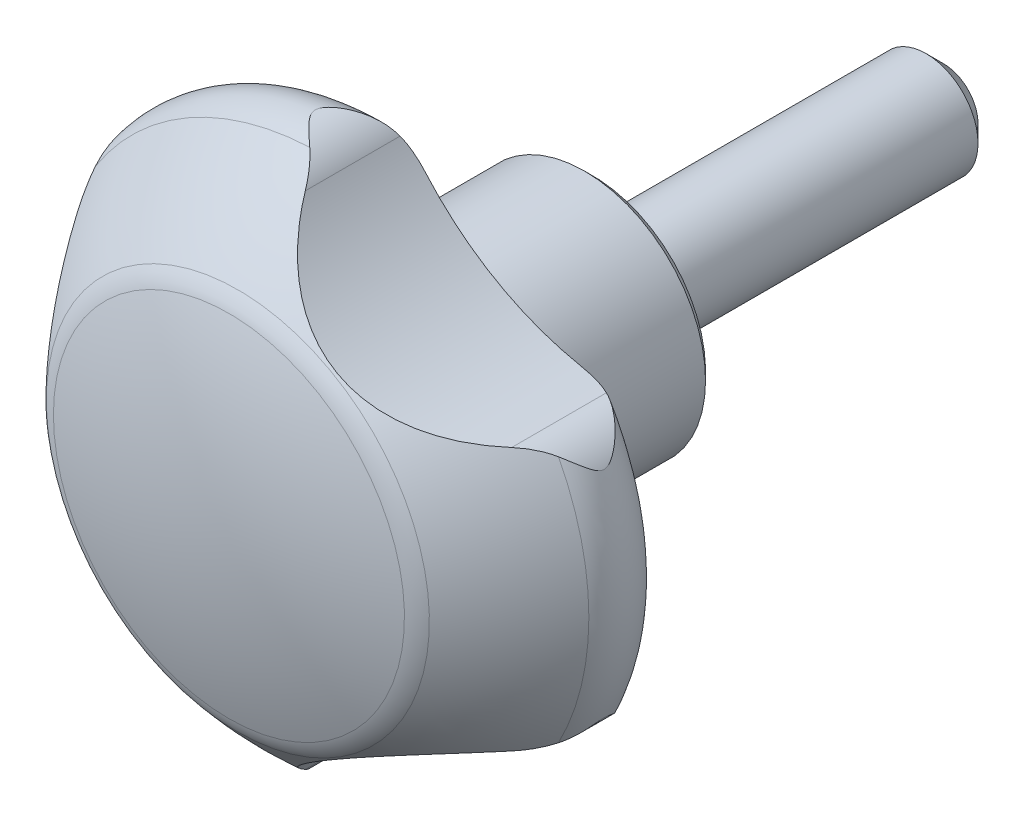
ISO-10303-21;
HEADER;
FILE_DESCRIPTION(('STEP AP214'),'2;1');
FILE_NAME('part.step','',(''),(''),'','','');
FILE_SCHEMA(('AUTOMOTIVE_DESIGN { 1 0 10303 214 1 1 1 1 }'));
ENDSEC;
DATA;
#1=APPLICATION_CONTEXT('core data for automotive mechanical design processes');
#2=APPLICATION_PROTOCOL_DEFINITION('international standard','automotive_design',2000,#1);
#3=PRODUCT_CONTEXT('',#1,'mechanical');
#4=PRODUCT('Part','Part','',(#3));
#5=PRODUCT_RELATED_PRODUCT_CATEGORY('part','',(#4));
#6=PRODUCT_DEFINITION_FORMATION('','',#4);
#7=PRODUCT_DEFINITION_CONTEXT('part definition',#1,'design');
#8=PRODUCT_DEFINITION('design','',#6,#7);
#9=PRODUCT_DEFINITION_SHAPE('','',#8);
#10=(LENGTH_UNIT() NAMED_UNIT(*) SI_UNIT(.MILLI.,.METRE.));
#11=(NAMED_UNIT(*) PLANE_ANGLE_UNIT() SI_UNIT($,.RADIAN.));
#12=(NAMED_UNIT(*) SI_UNIT($,.STERADIAN.) SOLID_ANGLE_UNIT());
#13=UNCERTAINTY_MEASURE_WITH_UNIT(LENGTH_MEASURE(1.E-05),#10,'distance_accuracy_value','');
#14=(GEOMETRIC_REPRESENTATION_CONTEXT(3) GLOBAL_UNCERTAINTY_ASSIGNED_CONTEXT((#13)) GLOBAL_UNIT_ASSIGNED_CONTEXT((#10,
#11,#12)) REPRESENTATION_CONTEXT('',''));
#15=CARTESIAN_POINT('',(0.,0.,0.));
#16=DIRECTION('',(0.,0.,1.));
#17=DIRECTION('',(1.,0.,0.));
#18=AXIS2_PLACEMENT_3D('',#15,#16,#17);
#19=CARTESIAN_POINT('',(0.,0.,14.375));
#20=DIRECTION('',(0.,0.,1.));
#21=DIRECTION('',(0.,-1.,0.));
#22=AXIS2_PLACEMENT_3D('',#19,#20,#21);
#23=TOROIDAL_SURFACE('',#22,13.125,2.875);
#24=CARTESIAN_POINT('',(0.,0.,11.5));
#25=DIRECTION('',(0.,0.,1.));
#26=DIRECTION('',(0.,-1.,0.));
#27=AXIS2_PLACEMENT_3D('',#24,#25,#26);
#28=CIRCLE('',#27,13.125);
#29=CARTESIAN_POINT('',(-12.0607651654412,-5.1772163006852,11.5));
#30=VERTEX_POINT('',#29);
#31=CARTESIAN_POINT('',(1.5467817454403,-13.0335371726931,11.5));
#32=VERTEX_POINT('',#31);
#33=EDGE_CURVE('E354',#30,#32,#28,.T.);
#34=ORIENTED_EDGE('',*,*,#33,.T.);
#35=CARTESIAN_POINT('',(12.3504229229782,-7.60476070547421,11.8522933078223));
#36=CARTESIAN_POINT('',(12.2372206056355,-7.61360791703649,11.8021242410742));
#37=CARTESIAN_POINT('',(12.1215849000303,-7.6238986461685,11.7580131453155));
#38=CARTESIAN_POINT('',(11.8871589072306,-7.64740774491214,11.68117773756));
#39=CARTESIAN_POINT('',(11.7683765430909,-7.66061928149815,11.6484273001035));
#40=CARTESIAN_POINT('',(11.5313012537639,-7.68974756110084,11.5939270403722));
#41=CARTESIAN_POINT('',(11.413048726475,-7.70560291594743,11.5719643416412));
#42=CARTESIAN_POINT('',(11.1755816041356,-7.74018356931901,11.5370888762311));
#43=CARTESIAN_POINT('',(11.0563664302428,-7.75891073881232,11.524182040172));
#44=CARTESIAN_POINT('',(10.7595038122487,-7.8090188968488,11.5021196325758));
#45=CARTESIAN_POINT('',(10.5817779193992,-7.84211070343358,11.4978813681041));
#46=CARTESIAN_POINT('',(10.2277731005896,-7.9142544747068,11.5040305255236));
#47=CARTESIAN_POINT('',(10.0514954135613,-7.95331107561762,11.5144293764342));
#48=CARTESIAN_POINT('',(9.69899926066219,-8.03765989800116,11.5468949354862));
#49=CARTESIAN_POINT('',(9.52281492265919,-8.08303046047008,11.5691200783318));
#50=CARTESIAN_POINT('',(9.17340527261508,-8.17934747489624,11.6221449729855));
#51=CARTESIAN_POINT('',(9.0001790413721,-8.23029215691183,11.6529420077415));
#52=CARTESIAN_POINT('',(8.54868011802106,-8.37135477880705,11.7411325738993));
#53=CARTESIAN_POINT('',(8.27272209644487,-8.46598921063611,11.8030864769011));
#54=CARTESIAN_POINT('',(7.86303063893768,-8.61907637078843,11.8968306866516));
#55=CARTESIAN_POINT('',(7.72708016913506,-8.67200254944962,11.9282367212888));
#56=CARTESIAN_POINT('',(7.45634930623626,-8.78169396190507,11.9894583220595));
#57=CARTESIAN_POINT('',(7.32156895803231,-8.83845934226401,12.0192738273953));
#58=CARTESIAN_POINT('',(7.05521634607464,-8.95498073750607,12.0748997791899));
#59=CARTESIAN_POINT('',(6.92362794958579,-9.01467153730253,12.100768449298));
#60=CARTESIAN_POINT('',(6.66136679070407,-9.13797315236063,12.147180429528));
#61=CARTESIAN_POINT('',(6.53069380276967,-9.20158296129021,12.1677250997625));
#62=CARTESIAN_POINT('',(6.27071311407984,-9.33257633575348,12.2017006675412));
#63=CARTESIAN_POINT('',(6.14140278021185,-9.39994985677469,12.2151495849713));
#64=CARTESIAN_POINT('',(5.8842116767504,-9.53847548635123,12.2337117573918));
#65=CARTESIAN_POINT('',(5.75633076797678,-9.60962722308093,12.2388258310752));
#66=CARTESIAN_POINT('',(5.50072525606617,-9.75647865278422,12.2401947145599));
#67=CARTESIAN_POINT('',(5.3730288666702,-9.83222871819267,12.236322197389));
#68=CARTESIAN_POINT('',(5.12020309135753,-9.98699196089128,12.219869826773));
#69=CARTESIAN_POINT('',(4.99507396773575,-10.0660054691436,12.2072890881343));
#70=CARTESIAN_POINT('',(4.7474352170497,-10.22720057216,12.174646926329));
#71=CARTESIAN_POINT('',(4.62493319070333,-10.3093898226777,12.1545662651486));
#72=CARTESIAN_POINT('',(4.38295146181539,-10.4766074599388,12.1087153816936));
#73=CARTESIAN_POINT('',(4.26347259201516,-10.5616366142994,12.0829436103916));
#74=CARTESIAN_POINT('',(4.02578640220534,-10.7357331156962,12.0272962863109));
#75=CARTESIAN_POINT('',(3.90762119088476,-10.8248406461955,11.9973676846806));
#76=CARTESIAN_POINT('',(3.6741154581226,-11.0060445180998,11.9357191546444));
#77=CARTESIAN_POINT('',(3.55877483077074,-11.0981407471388,11.9039992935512));
#78=CARTESIAN_POINT('',(3.21688385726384,-11.3789493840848,11.8091287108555));
#79=CARTESIAN_POINT('',(2.99411849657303,-11.5724352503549,11.7461743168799));
#80=CARTESIAN_POINT('',(2.65836230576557,-11.8808762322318,11.6605987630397));
#81=CARTESIAN_POINT('',(2.54214920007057,-11.9908709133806,11.632770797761));
#82=CARTESIAN_POINT('',(2.3123384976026,-12.2150585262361,11.5834795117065));
#83=CARTESIAN_POINT('',(2.19874166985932,-12.3292526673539,11.562018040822));
#84=CARTESIAN_POINT('',(1.97493262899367,-12.5611808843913,11.5277505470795));
#85=CARTESIAN_POINT('',(1.86470716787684,-12.6788960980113,11.5149048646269));
#86=CARTESIAN_POINT('',(1.64755158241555,-12.9179860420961,11.4999662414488));
#87=CARTESIAN_POINT('',(1.54062004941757,-13.039359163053,11.4978686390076));
#88=CARTESIAN_POINT('',(1.35689626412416,-13.2543800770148,11.5056455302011));
#89=CARTESIAN_POINT('',(1.27924001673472,-13.3473909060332,11.5126639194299));
#90=CARTESIAN_POINT('',(1.12650802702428,-13.5345845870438,11.5350756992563));
#91=CARTESIAN_POINT('',(1.05143277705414,-13.6287676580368,11.5504706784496));
#92=CARTESIAN_POINT('',(0.904544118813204,-13.8173259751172,11.5905636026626));
#93=CARTESIAN_POINT('',(0.832722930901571,-13.9117001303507,11.615237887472));
#94=CARTESIAN_POINT('',(0.692731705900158,-14.0998797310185,11.6747820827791));
#95=CARTESIAN_POINT('',(0.624558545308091,-14.1936855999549,11.7096431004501));
#96=CARTESIAN_POINT('',(0.533235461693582,-14.3221713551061,11.7653941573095));
#97=CARTESIAN_POINT('',(0.508262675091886,-14.3576157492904,11.781630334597));
#98=CARTESIAN_POINT('',(0.458972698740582,-14.428172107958,11.8157367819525));
#99=CARTESIAN_POINT('',(0.434655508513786,-14.4632840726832,11.833607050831));
#100=CARTESIAN_POINT('',(0.410680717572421,-14.4981949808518,11.8523118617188));
#101=B_SPLINE_CURVE_WITH_KNOTS('',3,(#35,#36,#37,#38,#39,#40,#41,#42,#43,#44,#45,#46,#47,#48,
#49,#50,#51,#52,#53,#54,#55,#56,#57,#58,#59,#60,#61,#62,#63,#64,#65,#66,#67,#68,#69,#70,#71,#72,
#73,#74,#75,#76,#77,#78,#79,#80,#81,#82,#83,#84,#85,#86,#87,#88,#89,#90,#91,#92,#93,#94,#95,#96,
#97,#98,#99,#100),.UNSPECIFIED.,.F.,.F.,(4,2,2,2,2,2,2,2,2,2,2,2,2,2,2,2,2,2,2,2,2,2,2,2,2,2,2,
2,2,2,2,2,4),(0.,0.372049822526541,0.743238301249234,1.10677407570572,1.47054770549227,
2.01213205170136,2.55413951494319,3.1035980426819,3.65288260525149,4.54695277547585,
4.99461886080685,5.44230204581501,5.88256027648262,6.32270592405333,6.76172836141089,
7.20070767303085,7.6459445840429,8.09122676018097,8.53765906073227,8.98421302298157,
9.43710431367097,9.8899785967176,10.7944122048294,11.2815100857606,11.7687493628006,
12.2537301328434,12.7385005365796,13.1023365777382,13.4662416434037,13.8292250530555,
14.1918925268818,14.330759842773,14.4696270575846),.UNSPECIFIED.);
#102=CARTESIAN_POINT('',(0.41081806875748,-14.4979949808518,11.8522047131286));
#103=VERTEX_POINT('',#102);
#104=EDGE_CURVE('E151',#32,#103,#101,.T.);
#105=ORIENTED_EDGE('',*,*,#104,.T.);
#106=CARTESIAN_POINT('',(-0.660737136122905,-15.4768930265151,16.0083135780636));
#107=CARTESIAN_POINT('',(-0.743879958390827,-15.5235900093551,15.9355175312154));
#108=CARTESIAN_POINT('',(-0.828001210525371,-15.5658884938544,15.8610782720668));
#109=CARTESIAN_POINT('',(-0.997153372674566,-15.6420933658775,15.7083723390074));
#110=CARTESIAN_POINT('',(-1.08218640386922,-15.6759707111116,15.6300935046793));
#111=CARTESIAN_POINT('',(-1.25382578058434,-15.7362297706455,15.4674848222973));
#112=CARTESIAN_POINT('',(-1.34041230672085,-15.762383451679,15.3830484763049));
#113=CARTESIAN_POINT('',(-1.46752732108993,-15.7952896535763,15.2522937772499));
#114=CARTESIAN_POINT('',(-1.50940521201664,-15.8051988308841,15.2080632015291));
#115=CARTESIAN_POINT('',(-1.59162682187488,-15.8229807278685,15.11781274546));
#116=CARTESIAN_POINT('',(-1.6319711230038,-15.8308542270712,15.0717935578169));
#117=CARTESIAN_POINT('',(-1.70885295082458,-15.8444180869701,14.9788569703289));
#118=CARTESIAN_POINT('',(-1.74547114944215,-15.8501704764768,14.9320159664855));
#119=CARTESIAN_POINT('',(-1.81458696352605,-15.8599162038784,14.8352306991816));
#120=CARTESIAN_POINT('',(-1.84709237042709,-15.8639129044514,14.78529257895));
#121=CARTESIAN_POINT('',(-1.89627723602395,-15.8693447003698,14.6963386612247));
#122=CARTESIAN_POINT('',(-1.91480566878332,-15.8711870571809,14.658395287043));
#123=CARTESIAN_POINT('',(-1.94607474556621,-15.8740981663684,14.5801882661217));
#124=CARTESIAN_POINT('',(-1.95883515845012,-15.8751695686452,14.5399330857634));
#125=CARTESIAN_POINT('',(-1.97448778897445,-15.8764439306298,14.4659015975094));
#126=CARTESIAN_POINT('',(-1.97884771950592,-15.8767781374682,14.4324488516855));
#127=CARTESIAN_POINT('',(-1.98162234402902,-15.876993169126,14.3652926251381));
#128=CARTESIAN_POINT('',(-1.98003924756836,-15.8768741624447,14.3315892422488));
#129=CARTESIAN_POINT('',(-1.97125509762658,-15.8761807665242,14.2651289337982));
#130=CARTESIAN_POINT('',(-1.96408062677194,-15.8756085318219,14.2323682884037));
#131=CARTESIAN_POINT('',(-1.94520315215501,-15.8739968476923,14.1681959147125));
#132=CARTESIAN_POINT('',(-1.9334939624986,-15.8729567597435,14.1367860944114));
#133=CARTESIAN_POINT('',(-1.88636602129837,-15.8684052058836,14.0283531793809));
#134=CARTESIAN_POINT('',(-1.84214837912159,-15.8635511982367,13.9553463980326));
#135=CARTESIAN_POINT('',(-1.74486500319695,-15.8502796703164,13.8156392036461));
#136=CARTESIAN_POINT('',(-1.69172255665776,-15.8418301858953,13.7490020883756));
#137=CARTESIAN_POINT('',(-1.55697489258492,-15.8165202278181,13.5912869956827));
#138=CARTESIAN_POINT('',(-1.47316526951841,-15.7975931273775,13.5024135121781));
#139=CARTESIAN_POINT('',(-1.30259678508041,-15.7512723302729,13.3297547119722));
#140=CARTESIAN_POINT('',(-1.21583358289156,-15.7238656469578,13.2459774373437));
#141=CARTESIAN_POINT('',(-1.04187072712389,-15.6602989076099,13.0825576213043));
#142=CARTESIAN_POINT('',(-0.954671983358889,-15.6241527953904,13.0029087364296));
#143=CARTESIAN_POINT('',(-0.781286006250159,-15.5428179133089,12.8473483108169));
#144=CARTESIAN_POINT('',(-0.695098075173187,-15.49763582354,12.7714340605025));
#145=CARTESIAN_POINT('',(-0.537377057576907,-15.4052729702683,12.634328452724));
#146=CARTESIAN_POINT('',(-0.465554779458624,-15.3593661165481,12.5726151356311));
#147=CARTESIAN_POINT('',(-0.324154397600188,-15.2606269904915,12.4522583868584));
#148=CARTESIAN_POINT('',(-0.254576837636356,-15.2077930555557,12.3936156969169));
#149=CARTESIAN_POINT('',(-0.0506782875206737,-15.0389726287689,12.2232234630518));
#150=CARTESIAN_POINT('',(0.0794541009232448,-14.9122996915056,12.1164528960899));
#151=CARTESIAN_POINT('',(0.237285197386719,-14.728580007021,11.9894462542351));
#152=CARTESIAN_POINT('',(0.273356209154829,-14.684277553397,11.9606115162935));
#153=CARTESIAN_POINT('',(0.34361441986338,-14.5930239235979,11.9048672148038));
#154=CARTESIAN_POINT('',(0.37780109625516,-14.5460720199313,11.8779581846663));
#155=CARTESIAN_POINT('',(0.410955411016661,-14.4977949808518,11.852097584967));
#156=B_SPLINE_CURVE_WITH_KNOTS('',3,(#106,#107,#108,#109,#110,#111,#112,#113,#114,#115,#116,
#117,#118,#119,#120,#121,#122,#123,#124,#125,#126,#127,#128,#129,#130,#131,#132,#133,#134,#135,
#136,#137,#138,#139,#140,#141,#142,#143,#144,#145,#146,#147,#148,#149,#150,#151,#152,#153,#154,
#155),.UNSPECIFIED.,.F.,.F.,(4,2,2,2,2,2,2,2,2,2,2,2,2,2,2,2,2,2,2,2,2,2,2,2,4),(0.,
0.359753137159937,0.720730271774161,1.09149073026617,1.27656973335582,1.46157775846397,
1.64064007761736,1.81935792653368,1.94585278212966,2.07191074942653,2.1726380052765,
2.27332781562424,2.37354182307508,2.47389301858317,2.72833085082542,2.98507953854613,
3.35522812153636,3.72594642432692,4.09607710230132,4.46593515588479,4.78133302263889,
5.09680672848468,5.72499481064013,5.91689744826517,6.10885303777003),.UNSPECIFIED.);
#157=CARTESIAN_POINT('',(-0.660965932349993,-15.4770214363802,16.0081135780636));
#158=VERTEX_POINT('',#157);
#159=EDGE_CURVE('E146',#158,#103,#156,.T.);
#160=ORIENTED_EDGE('',*,*,#159,.F.);
#161=CARTESIAN_POINT('',(0.,0.,16.0081135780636));
#162=DIRECTION('',(0.,0.,1.));
#163=DIRECTION('',(0.,-1.,0.));
#164=AXIS2_PLACEMENT_3D('',#161,#162,#163);
#165=CIRCLE('',#164,15.4911287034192);
#166=CARTESIAN_POINT('',(-13.0730107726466,-8.31092400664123,16.0081135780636));
#167=VERTEX_POINT('',#166);
#168=EDGE_CURVE('E360',#167,#158,#165,.T.);
#169=ORIENTED_EDGE('',*,*,#168,.F.);
#170=CARTESIAN_POINT('',(-12.760945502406,-6.89301860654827,11.8521068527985));
#171=CARTESIAN_POINT('',(-12.8017830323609,-6.97854374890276,11.8939661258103));
#172=CARTESIAN_POINT('',(-12.8382622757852,-7.06471054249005,11.9385721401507));
#173=CARTESIAN_POINT('',(-12.9028485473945,-7.23744731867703,12.0324783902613));
#174=CARTESIAN_POINT('',(-12.9309682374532,-7.32401648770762,12.0817713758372));
#175=CARTESIAN_POINT('',(-12.9792488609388,-7.49675384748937,12.1842720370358));
#176=CARTESIAN_POINT('',(-12.9994270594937,-7.58292250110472,12.2374709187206));
#177=CARTESIAN_POINT('',(-13.0323566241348,-7.75449014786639,12.3473575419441));
#178=CARTESIAN_POINT('',(-13.045104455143,-7.83988875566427,12.4040469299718));
#179=CARTESIAN_POINT('',(-13.0657398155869,-8.02893694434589,12.5339254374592));
#180=CARTESIAN_POINT('',(-13.0718239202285,-8.13224464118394,12.6079005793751));
#181=CARTESIAN_POINT('',(-13.0742285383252,-8.33593136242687,12.7599455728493));
#182=CARTESIAN_POINT('',(-13.070546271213,-8.43630954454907,12.8380165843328));
#183=CARTESIAN_POINT('',(-13.0543419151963,-8.63290872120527,12.9978699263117));
#184=CARTESIAN_POINT('',(-13.0418409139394,-8.72913905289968,13.0796429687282));
#185=CARTESIAN_POINT('',(-13.0090930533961,-8.91644401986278,13.2473439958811));
#186=CARTESIAN_POINT('',(-12.9888512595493,-9.00752198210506,13.3332692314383));
#187=CARTESIAN_POINT('',(-12.9507899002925,-9.15053180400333,13.4783287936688));
#188=CARTESIAN_POINT('',(-12.9347766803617,-9.20463195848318,13.5358125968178));
#189=CARTESIAN_POINT('',(-12.9009697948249,-9.30913269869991,13.6542498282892));
#190=CARTESIAN_POINT('',(-12.8831664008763,-9.35951016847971,13.715221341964));
#191=CARTESIAN_POINT('',(-12.846974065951,-9.4549032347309,13.8428458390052));
#192=CARTESIAN_POINT('',(-12.8285803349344,-9.49980871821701,13.9095799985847));
#193=CARTESIAN_POINT('',(-12.7951187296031,-9.57739439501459,14.0504700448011));
#194=CARTESIAN_POINT('',(-12.7800112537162,-9.61022388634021,14.1245198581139));
#195=CARTESIAN_POINT('',(-12.7660356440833,-9.64003927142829,14.2377341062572));
#196=CARTESIAN_POINT('',(-12.762806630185,-9.64680761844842,14.2735996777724));
#197=CARTESIAN_POINT('',(-12.7592845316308,-9.65418525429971,14.3460725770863));
#198=CARTESIAN_POINT('',(-12.7589856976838,-9.65480660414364,14.3826783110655));
#199=CARTESIAN_POINT('',(-12.7613747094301,-9.64980872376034,14.4552528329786));
#200=CARTESIAN_POINT('',(-12.7640562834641,-9.64420259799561,14.4912227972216));
#201=CARTESIAN_POINT('',(-12.7717974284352,-9.62777513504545,14.5617242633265));
#202=CARTESIAN_POINT('',(-12.7768643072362,-9.61693776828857,14.5962509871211));
#203=CARTESIAN_POINT('',(-12.793250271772,-9.58114238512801,14.6906772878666));
#204=CARTESIAN_POINT('',(-12.8063151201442,-9.55184677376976,14.7485677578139));
#205=CARTESIAN_POINT('',(-12.8340727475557,-9.48628502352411,14.8598696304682));
#206=CARTESIAN_POINT('',(-12.8487732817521,-9.44998502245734,14.9132573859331));
#207=CARTESIAN_POINT('',(-12.8881588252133,-9.34662069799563,15.052751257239));
#208=CARTESIAN_POINT('',(-12.9127203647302,-9.27563739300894,15.1359601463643));
#209=CARTESIAN_POINT('',(-12.9579023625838,-9.12687755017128,15.2973184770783));
#210=CARTESIAN_POINT('',(-12.9785147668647,-9.04908759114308,15.3754573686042));
#211=CARTESIAN_POINT('',(-13.0142869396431,-8.88880160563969,15.527956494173));
#212=CARTESIAN_POINT('',(-13.0294508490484,-8.80630920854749,15.6023195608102));
#213=CARTESIAN_POINT('',(-13.0533966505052,-8.63779304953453,15.7478271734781));
#214=CARTESIAN_POINT('',(-13.0621858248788,-8.55177343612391,15.8189753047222));
#215=CARTESIAN_POINT('',(-13.0689856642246,-8.43894643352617,15.9088148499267));
#216=CARTESIAN_POINT('',(-13.0702194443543,-8.41342393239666,15.9289132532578));
#217=CARTESIAN_POINT('',(-13.0720765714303,-8.36218993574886,15.9688220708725));
#218=CARTESIAN_POINT('',(-13.0727007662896,-8.33647875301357,15.9886328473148));
#219=CARTESIAN_POINT('',(-13.0730139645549,-8.31066165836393,16.0083135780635));
#220=B_SPLINE_CURVE_WITH_KNOTS('',3,(#170,#171,#172,#173,#174,#175,#176,#177,#178,#179,#180,
#181,#182,#183,#184,#185,#186,#187,#188,#189,#190,#191,#192,#193,#194,#195,#196,#197,#198,#199,
#200,#201,#202,#203,#204,#205,#206,#207,#208,#209,#210,#211,#212,#213,#214,#215,#216,#217,#218,
#219),.UNSPECIFIED.,.F.,.F.,(4,2,2,2,2,2,2,2,2,2,2,2,2,2,2,2,2,2,2,2,2,2,2,2,4),(0.,
0.310578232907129,0.620683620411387,0.930111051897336,1.23968557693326,1.62078500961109,
2.00199295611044,2.38229242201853,2.76234345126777,3.00386840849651,3.24678519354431,
3.49398204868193,3.73801095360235,3.84737591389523,3.95652624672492,4.06544732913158,
4.17470430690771,4.37212988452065,4.570534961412,4.90610543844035,5.2423531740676,
5.57834481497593,5.9139520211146,6.01147514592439,6.10886242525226),.UNSPECIFIED.);
#221=CARTESIAN_POINT('',(-12.7610409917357,-6.89321860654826,11.8522047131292));
#222=VERTEX_POINT('',#221);
#223=EDGE_CURVE('E141',#222,#167,#220,.T.);
#224=ORIENTED_EDGE('',*,*,#223,.F.);
#225=CARTESIAN_POINT('',(-12.7611364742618,-6.89341860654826,11.8523025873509));
#226=CARTESIAN_POINT('',(-12.7121972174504,-6.7909592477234,11.8021327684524));
#227=CARTESIAN_POINT('',(-12.6632913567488,-6.6856707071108,11.7580209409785));
#228=CARTESIAN_POINT('',(-12.5664377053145,-6.4708977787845,11.6811841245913));
#229=CARTESIAN_POINT('',(-12.5184879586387,-6.36142366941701,11.6484330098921));
#230=CARTESIAN_POINT('',(-12.4251759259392,-6.14154664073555,11.5939314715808));
#231=CARTESIAN_POINT('',(-12.3797806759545,-6.03120940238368,11.571968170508));
#232=CARTESIAN_POINT('',(-12.2909945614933,-5.80826672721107,11.5370915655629));
#233=CARTESIAN_POINT('',(-12.2476050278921,-5.69565985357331,11.5241841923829));
#234=CARTESIAN_POINT('',(-12.1425688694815,-5.41351699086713,11.502120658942));
#235=CARTESIAN_POINT('',(-12.0823645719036,-5.2430576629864,11.4978816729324));
#236=CARTESIAN_POINT('',(-11.9678409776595,-4.90041200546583,11.5040292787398));
#237=CARTESIAN_POINT('',(-11.9135263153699,-4.72822443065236,11.514427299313));
#238=CARTESIAN_POINT('',(-11.8103266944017,-4.38078277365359,11.5468911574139));
#239=CARTESIAN_POINT('',(-11.7615266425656,-4.20551907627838,11.5691154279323));
#240=CARTESIAN_POINT('',(-11.6702348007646,-3.85476632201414,11.6221386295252));
#241=CARTESIAN_POINT('',(-11.6277410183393,-3.67927735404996,11.6529348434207));
#242=CARTESIAN_POINT('',(-11.5241540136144,-3.21773619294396,11.7411243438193));
#243=CARTESIAN_POINT('',(-11.4681297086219,-2.93143031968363,11.8030783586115));
#244=CARTESIAN_POINT('',(-11.3958598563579,-2.50008056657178,11.896823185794));
#245=CARTESIAN_POINT('',(-11.3737195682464,-2.35587992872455,11.928229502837));
#246=CARTESIAN_POINT('',(-11.3333488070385,-2.06657244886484,11.9894517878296));
#247=CARTESIAN_POINT('',(-11.3151184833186,-1.92146557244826,12.0192676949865));
#248=CARTESIAN_POINT('',(-11.2828519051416,-1.63253480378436,12.074894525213));
#249=CARTESIAN_POINT('',(-11.268751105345,-1.48872954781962,12.1007636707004));
#250=CARTESIAN_POINT('',(-11.2444022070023,-1.19995197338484,12.1471766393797));
#251=CARTESIAN_POINT('',(-11.2341531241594,-1.05497996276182,12.1677218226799));
#252=CARTESIAN_POINT('',(-11.2176058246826,-0.764331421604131,12.2016983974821));
#253=CARTESIAN_POINT('',(-11.2112975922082,-0.618657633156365,12.2151478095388));
#254=CARTESIAN_POINT('',(-11.2026683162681,-0.326658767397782,12.2337108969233));
#255=CARTESIAN_POINT('',(-11.2003468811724,-0.180333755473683,12.238825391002));
#256=CARTESIAN_POINT('',(-11.1997208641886,0.11445499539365,12.2401949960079));
#257=CARTESIAN_POINT('',(-11.2014740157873,0.262919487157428,12.2363227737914));
#258=CARTESIAN_POINT('',(-11.2090898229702,0.559256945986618,12.2198708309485));
#259=CARTESIAN_POINT('',(-11.2149528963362,0.707129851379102,12.2072902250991));
#260=CARTESIAN_POINT('',(-11.2307324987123,1.0021911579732,12.1746481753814));
#261=CARTESIAN_POINT('',(-11.2406594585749,1.14937680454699,12.1545674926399));
#262=CARTESIAN_POINT('',(-11.2644833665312,1.44255023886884,12.1087164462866));
#263=CARTESIAN_POINT('',(-11.2783813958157,1.58853768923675,12.082944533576));
#264=CARTESIAN_POINT('',(-11.3103104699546,1.88143050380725,12.0272968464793));
#265=CARTESIAN_POINT('',(-11.3283973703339,2.02831949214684,11.9973680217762));
#266=CARTESIAN_POINT('',(-11.3685719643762,2.32114560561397,11.9357190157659));
#267=CARTESIAN_POINT('',(-11.3906595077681,2.46708276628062,11.9039989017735));
#268=CARTESIAN_POINT('',(-11.4629020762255,2.90357672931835,11.8091275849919));
#269=CARTESIAN_POINT('',(-11.5190836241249,3.19324235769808,11.7461727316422));
#270=CARTESIAN_POINT('',(-11.6183241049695,3.63823875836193,11.6605969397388));
#271=CARTESIAN_POINT('',(-11.655475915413,3.7938798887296,11.6327690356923));
#272=CARTESIAN_POINT('',(-11.734723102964,4.10499617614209,11.5834779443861));
#273=CARTESIAN_POINT('',(-11.7768199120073,4.26047127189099,11.5620166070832));
#274=CARTESIAN_POINT('',(-11.8657715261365,4.57026024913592,11.5277494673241));
#275=CARTESIAN_POINT('',(-11.9126033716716,4.72457617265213,11.5149040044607));
#276=CARTESIAN_POINT('',(-12.0110839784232,5.03218390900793,11.4999659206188));
#277=CARTESIAN_POINT('',(-12.0627306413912,5.18547613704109,11.4978686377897));
#278=CARTESIAN_POINT('',(-12.157082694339,5.45209638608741,11.5056461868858));
#279=CARTESIAN_POINT('',(-12.1988044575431,5.5658541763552,11.5126648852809));
#280=CARTESIAN_POINT('',(-12.2845532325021,5.7917209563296,11.5350773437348));
#281=CARTESIAN_POINT('',(-12.3285806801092,5.90382962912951,11.550472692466));
#282=CARTESIAN_POINT('',(-12.4184329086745,6.12531817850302,11.5905664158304));
#283=CARTESIAN_POINT('',(-12.4642528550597,6.23470424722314,11.6152411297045));
#284=CARTESIAN_POINT('',(-12.5572257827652,6.45002998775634,11.6747862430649));
#285=CARTESIAN_POINT('',(-12.604377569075,6.55597257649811,11.7096477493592));
#286=CARTESIAN_POINT('',(-12.6699855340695,6.6992979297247,11.7653973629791));
#287=CARTESIAN_POINT('',(-12.6881923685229,6.73864171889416,11.7816313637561));
#288=CARTESIAN_POINT('',(-12.7246459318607,6.81659551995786,11.8157330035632));
#289=CARTESIAN_POINT('',(-12.742892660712,6.85520553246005,11.8336006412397));
#290=CARTESIAN_POINT('',(-12.7611364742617,6.89341860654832,11.8523025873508));
#291=B_SPLINE_CURVE_WITH_KNOTS('',3,(#225,#226,#227,#228,#229,#230,#231,#232,#233,#234,#235,
#236,#237,#238,#239,#240,#241,#242,#243,#244,#245,#246,#247,#248,#249,#250,#251,#252,#253,#254,
#255,#256,#257,#258,#259,#260,#261,#262,#263,#264,#265,#266,#267,#268,#269,#270,#271,#272,#273,
#274,#275,#276,#277,#278,#279,#280,#281,#282,#283,#284,#285,#286,#287,#288,#289,#290),
.UNSPECIFIED.,.F.,.F.,(4,2,2,2,2,2,2,2,2,2,2,2,2,2,2,2,2,2,2,2,2,2,2,2,2,2,2,2,2,2,2,2,4),(0.,
0.372049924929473,0.743238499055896,1.10677437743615,1.47054811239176,2.01212737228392,
2.55412973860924,3.10358303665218,3.65286236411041,4.54693895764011,4.99460829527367,
5.44229473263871,5.88255614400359,6.32270497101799,6.76173054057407,7.20071298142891,
7.6459532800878,8.09123884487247,8.53767457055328,8.9842319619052,9.43712677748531,
9.89000458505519,10.7944452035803,11.2815439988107,11.7687841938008,12.2537658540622,
12.7385371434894,13.1023736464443,13.4662791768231,13.8292630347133,14.1919309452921,
14.3307790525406,14.4696270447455),.UNSPECIFIED.);
#292=EDGE_CURVE('E132',#222,#30,#291,.T.);
#293=ORIENTED_EDGE('',*,*,#292,.T.);
#294=EDGE_LOOP('',(#34,#105,#160,#169,#224,#293));
#295=FACE_BOUND('',#294,.T.);
#296=ADVANCED_FACE('F14',(#295),#23,.T.);
#297=CARTESIAN_POINT('',(0.410955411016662,14.4977949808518,11.852097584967));
#298=CARTESIAN_POINT('',(0.357307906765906,14.5759240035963,11.8939562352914));
#299=CARTESIAN_POINT('',(0.300925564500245,14.6505995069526,11.9385616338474));
#300=CARTESIAN_POINT('',(0.183625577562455,14.792901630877,12.0324666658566));
#301=CARTESIAN_POINT('',(0.122714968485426,14.8605388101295,12.0817590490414));
#302=CARTESIAN_POINT('',(-0.00273837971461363,14.9887202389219,12.1842585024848));
#303=CARTESIAN_POINT('',(-0.0672728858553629,15.0492796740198,12.2374567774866));
#304=CARTESIAN_POINT('',(-0.199388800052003,15.1635819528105,12.3473421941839));
#305=CARTESIAN_POINT('',(-0.26697164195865,15.2173215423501,12.4040309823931));
#306=CARTESIAN_POINT('',(-0.420373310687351,15.3297172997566,12.5339082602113));
#307=CARTESIAN_POINT('',(-0.506797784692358,15.3866407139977,12.6078827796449));
#308=CARTESIAN_POINT('',(-0.681992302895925,15.4905677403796,12.759926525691));
#309=CARTESIAN_POINT('',(-0.77076300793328,15.5375685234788,12.8379969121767));
#310=CARTESIAN_POINT('',(-0.949124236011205,15.6218360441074,12.9978489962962));
#311=CARTESIAN_POINT('',(-1.0387123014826,15.6591257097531,13.0796214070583));
#312=CARTESIAN_POINT('',(-1.21729657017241,15.7244191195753,13.2473210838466));
#313=CARTESIAN_POINT('',(-1.30629312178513,15.7524289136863,13.3332456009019));
#314=CARTESIAN_POINT('',(-1.44917526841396,15.7909732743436,13.4783051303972));
#315=CARTESIAN_POINT('',(-1.50403535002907,15.8041562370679,13.5357897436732));
#316=CARTESIAN_POINT('',(-1.61144191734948,15.8271303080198,13.654228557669));
#317=CARTESIAN_POINT('',(-1.66397325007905,15.8369014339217,13.7152008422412));
#318=CARTESIAN_POINT('',(-1.76468530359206,15.8532554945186,13.8428267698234));
#319=CARTESIAN_POINT('',(-1.81277306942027,15.8597792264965,13.909561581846));
#320=CARTESIAN_POINT('',(-1.89669874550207,15.8695941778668,14.050452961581));
#321=CARTESIAN_POINT('',(-1.93268573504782,15.8729257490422,14.1245034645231));
#322=CARTESIAN_POINT('',(-1.9654974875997,15.8757305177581,14.2377187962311));
#323=CARTESIAN_POINT('',(-1.97297450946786,15.8763183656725,14.2735844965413));
#324=CARTESIAN_POINT('',(-1.98112668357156,15.8769571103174,14.3460578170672));
#325=CARTESIAN_POINT('',(-1.98181515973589,15.8770090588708,14.382663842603));
#326=CARTESIAN_POINT('',(-1.9762940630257,15.8765791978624,14.4552391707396));
#327=CARTESIAN_POINT('',(-1.97009896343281,15.8760985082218,14.4912096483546));
#328=CARTESIAN_POINT('',(-1.95200295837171,15.8745889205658,14.561712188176));
#329=CARTESIAN_POINT('',(-1.94008451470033,15.8735583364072,14.5962394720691));
#330=CARTESIAN_POINT('',(-1.90089391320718,15.8698515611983,14.6906643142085));
#331=CARTESIAN_POINT('',(-1.86899277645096,15.8665185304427,14.748553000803));
#332=CARTESIAN_POINT('',(-1.79833994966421,15.857777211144,14.8598514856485));
#333=CARTESIAN_POINT('',(-1.75955505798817,15.8523587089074,14.9132376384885));
#334=CARTESIAN_POINT('',(-1.65035129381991,15.834786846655,15.0527279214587));
#335=CARTESIAN_POINT('',(-1.57660012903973,15.8205671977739,15.1359348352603));
#336=CARTESIAN_POINT('',(-1.42518505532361,15.7853186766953,15.2972892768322));
#337=CARTESIAN_POINT('',(-1.34751354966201,15.7642761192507,15.3754262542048));
#338=CARTESIAN_POINT('',(-1.19082105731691,15.7151163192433,15.5279216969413));
#339=CARTESIAN_POINT('',(-1.11180114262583,15.687004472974,15.602282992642));
#340=CARTESIAN_POINT('',(-0.953893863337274,15.6234886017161,15.7477872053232));
#341=CARTESIAN_POINT('',(-0.875006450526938,15.5880929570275,15.8189337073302));
#342=CARTESIAN_POINT('',(-0.773889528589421,15.5375674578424,15.9087791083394));
#343=CARTESIAN_POINT('',(-0.751161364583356,15.5258708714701,15.9288848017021));
#344=CARTESIAN_POINT('',(-0.705846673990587,15.5018541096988,15.968807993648));
#345=CARTESIAN_POINT('',(-0.683259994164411,15.4895348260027,15.9886258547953));
#346=CARTESIAN_POINT('',(-0.660737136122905,15.4768930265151,16.0083135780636));
#347=B_SPLINE_CURVE_WITH_KNOTS('',3,(#297,#298,#299,#300,#301,#302,#303,#304,#305,#306,#307,
#308,#309,#310,#311,#312,#313,#314,#315,#316,#317,#318,#319,#320,#321,#322,#323,#324,#325,#326,
#327,#328,#329,#330,#331,#332,#333,#334,#335,#336,#337,#338,#339,#340,#341,#342,#343,#344,#345,
#346),.UNSPECIFIED.,.F.,.F.,(4,2,2,2,2,2,2,2,2,2,2,2,2,2,2,2,2,2,2,2,2,2,2,2,4),(0.,
0.31057668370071,0.620680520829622,0.930106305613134,1.23967918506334,1.62077715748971,
2.00198363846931,2.38228175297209,2.762331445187,3.00386128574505,3.24678287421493,
3.4939842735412,3.73801790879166,3.84738385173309,3.95653509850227,4.06545727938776,
4.17471538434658,4.37213334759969,4.57053073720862,4.90609058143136,5.2423276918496,
5.57830891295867,5.91390571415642,6.01146354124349,6.10888541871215),.UNSPECIFIED.);
#348=CARTESIAN_POINT('',(0.410818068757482,14.4979949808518,11.8522047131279));
#349=VERTEX_POINT('',#348);
#350=CARTESIAN_POINT('',(-0.660965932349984,15.4770214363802,16.0081135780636));
#351=VERTEX_POINT('',#350);
#352=EDGE_CURVE('E278',#349,#351,#347,.T.);
#353=ORIENTED_EDGE('',*,*,#352,.F.);
#354=CARTESIAN_POINT('',(0.410680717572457,14.4981949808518,11.8523118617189));
#355=CARTESIAN_POINT('',(0.474943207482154,14.4045828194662,11.802141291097));
#356=CARTESIAN_POINT('',(0.541672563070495,14.3095849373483,11.7580287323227));
#357=CARTESIAN_POINT('',(0.679244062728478,14.1183208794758,11.6811905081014));
#358=CARTESIAN_POINT('',(0.750076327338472,14.0220581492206,11.6484387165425));
#359=CARTESIAN_POINT('',(0.893839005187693,13.8313090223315,11.5939359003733));
#360=CARTESIAN_POINT('',(0.966696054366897,13.7368269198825,11.5719719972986));
#361=CARTESIAN_POINT('',(1.11537669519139,13.5484644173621,11.5370942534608));
#362=CARTESIAN_POINT('',(1.19120219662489,13.4545844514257,11.5241863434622));
#363=CARTESIAN_POINT('',(1.38302556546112,13.2225501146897,11.5021216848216));
#364=CARTESIAN_POINT('',(1.50054419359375,13.0851831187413,11.497881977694));
#365=CARTESIAN_POINT('',(1.74001954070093,12.8146820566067,11.5040280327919));
#366=CARTESIAN_POINT('',(1.86197965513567,12.6815513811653,11.5144252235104));
#367=CARTESIAN_POINT('',(2.11127033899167,12.4184589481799,11.5468873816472));
#368=CARTESIAN_POINT('',(2.23865168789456,12.2885659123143,11.5691107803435));
#369=CARTESIAN_POINT('',(2.49676363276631,12.0341301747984,11.6221322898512));
#370=CARTESIAN_POINT('',(2.62749315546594,11.9095857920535,11.6529276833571));
#371=CARTESIAN_POINT('',(2.97540561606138,11.5891049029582,11.741116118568));
#372=CARTESIAN_POINT('',(3.19534279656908,11.3974315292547,11.8030702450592));
#373=CARTESIAN_POINT('',(3.53276953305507,11.1191663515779,11.8968156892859));
#374=CARTESIAN_POINT('',(3.64658142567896,11.0278910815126,11.9282222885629));
#375=CARTESIAN_POINT('',(3.87694493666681,10.8482734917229,11.9894452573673));
#376=CARTESIAN_POINT('',(3.99349665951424,10.7599312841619,12.0192615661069));
#377=CARTESIAN_POINT('',(4.22758605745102,10.5875205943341,12.0748892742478));
#378=CARTESIAN_POINT('',(4.34507531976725,10.5034055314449,12.100758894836));
#379=CARTESIAN_POINT('',(4.58299094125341,10.3379284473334,12.1471728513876));
#380=CARTESIAN_POINT('',(4.70341654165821,10.2565657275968,12.1677185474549));
#381=CARTESIAN_POINT('',(4.94685334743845,10.096909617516,12.201696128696));
#382=CARTESIAN_POINT('',(5.06985716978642,10.018608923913,12.2151460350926));
#383=CARTESIAN_POINT('',(5.3184224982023,9.86513492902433,12.2337100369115));
#384=CARTESIAN_POINT('',(5.44398375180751,9.78996132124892,12.2388249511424));
#385=CARTESIAN_POINT('',(5.69896700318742,9.64202342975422,12.2401952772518));
#386=CARTESIAN_POINT('',(5.82841852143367,9.56930877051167,12.2363233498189));
#387=CARTESIAN_POINT('',(6.08886407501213,9.42773420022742,12.2198718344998));
#388=CARTESIAN_POINT('',(6.2198582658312,9.35887468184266,12.2072913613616));
#389=CARTESIAN_POINT('',(6.48328061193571,9.22500834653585,12.174649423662));
#390=CARTESIAN_POINT('',(6.61571159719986,9.16001194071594,12.154568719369));
#391=CARTESIAN_POINT('',(6.88152120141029,9.03405623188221,12.1087175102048));
#392=CARTESIAN_POINT('',(7.01490006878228,8.9730980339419,12.0829454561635));
#393=CARTESIAN_POINT('',(7.28451928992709,8.85430202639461,12.0272974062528));
#394=CARTESIAN_POINT('',(7.42077338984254,8.7965207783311,11.9973683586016));
#395=CARTESIAN_POINT('',(7.69445766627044,8.6848990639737,11.9357188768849));
#396=CARTESIAN_POINT('',(7.83188779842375,8.63105844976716,11.9039985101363));
#397=CARTESIAN_POINT('',(8.24602718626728,8.47537423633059,11.809126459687));
#398=CARTESIAN_POINT('',(8.52497796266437,8.37919543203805,11.7461711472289));
#399=CARTESIAN_POINT('',(8.95997899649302,8.24264148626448,11.6605951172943));
#400=CARTESIAN_POINT('',(9.11334441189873,8.19699534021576,11.6327672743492));
#401=CARTESIAN_POINT('',(9.42240329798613,8.11006730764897,11.5834763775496));
#402=CARTESIAN_POINT('',(9.57809743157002,8.06878669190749,11.5620151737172));
#403=CARTESIAN_POINT('',(9.89085904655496,7.99092663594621,11.5277483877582));
#404=CARTESIAN_POINT('',(10.0479168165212,7.95432629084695,11.5149031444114));
#405=CARTESIAN_POINT('',(10.3635538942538,7.88580925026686,11.4999655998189));
#406=CARTESIAN_POINT('',(10.5221325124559,7.85389053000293,11.4978686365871));
#407=CARTESIAN_POINT('',(10.8002089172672,7.80229183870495,11.5056468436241));
#408=CARTESIAN_POINT('',(10.919587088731,7.78154513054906,11.5126658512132));
#409=CARTESIAN_POINT('',(11.1580681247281,7.74287252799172,11.5350789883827));
#410=CARTESIAN_POINT('',(11.2771709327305,7.72494716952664,11.5504747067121));
#411=CARTESIAN_POINT('',(11.5139119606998,7.69201739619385,11.5905692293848));
#412=CARTESIAN_POINT('',(11.6315531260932,7.67700569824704,11.6152443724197));
#413=CARTESIAN_POINT('',(11.864517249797,7.64985994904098,11.6747904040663));
#414=CARTESIAN_POINT('',(11.9798421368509,7.63772340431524,11.7096523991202));
#415=CARTESIAN_POINT('',(12.136763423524,7.62287961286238,11.7654005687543));
#416=CARTESIAN_POINT('',(12.179933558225,7.61897585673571,11.7816323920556));
#417=CARTESIAN_POINT('',(12.2656584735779,7.61156967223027,11.8157292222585));
#418=CARTESIAN_POINT('',(12.3082132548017,7.60806724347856,11.8335942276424));
#419=CARTESIAN_POINT('',(12.3504229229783,7.60476070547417,11.8522933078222));
#420=B_SPLINE_CURVE_WITH_KNOTS('',3,(#354,#355,#356,#357,#358,#359,#360,#361,#362,#363,#364,
#365,#366,#367,#368,#369,#370,#371,#372,#373,#374,#375,#376,#377,#378,#379,#380,#381,#382,#383,
#384,#385,#386,#387,#388,#389,#390,#391,#392,#393,#394,#395,#396,#397,#398,#399,#400,#401,#402,
#403,#404,#405,#406,#407,#408,#409,#410,#411,#412,#413,#414,#415,#416,#417,#418,#419),
.UNSPECIFIED.,.F.,.F.,(4,2,2,2,2,2,2,2,2,2,2,2,2,2,2,2,2,2,2,2,2,2,2,2,2,2,2,2,2,2,2,2,4),(0.,
0.372050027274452,0.743238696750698,1.10677467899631,1.47054851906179,2.01212269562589,
2.5541199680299,3.10356803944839,3.65284213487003,4.5469251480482,4.99459773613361,
5.44228742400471,5.88255201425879,6.32270401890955,6.76173271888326,7.20071828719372,
7.64596197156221,8.09125092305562,8.53769007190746,8.9842508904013,9.43714922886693,
9.89003055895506,10.7944781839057,11.2815778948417,11.7688190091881,12.2538015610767,
12.7385737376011,13.1024107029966,13.4663166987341,13.8293010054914,14.1919693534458,
14.3307982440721,14.4696270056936),.UNSPECIFIED.);
#421=CARTESIAN_POINT('',(1.5467817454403,13.0335371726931,11.5));
#422=VERTEX_POINT('',#421);
#423=EDGE_CURVE('E271',#349,#422,#420,.T.);
#424=ORIENTED_EDGE('',*,*,#423,.T.);
#425=CARTESIAN_POINT('',(-12.0607651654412,5.17721630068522,11.5));
#426=VERTEX_POINT('',#425);
#427=EDGE_CURVE('E129',#422,#426,#28,.T.);
#428=ORIENTED_EDGE('',*,*,#427,.T.);
#429=CARTESIAN_POINT('',(-12.7610409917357,6.89321860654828,11.8522047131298));
#430=VERTEX_POINT('',#429);
#431=EDGE_CURVE('E113',#426,#430,#291,.T.);
#432=ORIENTED_EDGE('',*,*,#431,.T.);
#433=CARTESIAN_POINT('',(-13.0730139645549,8.31066165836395,16.0083135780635));
#434=CARTESIAN_POINT('',(-13.0718833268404,8.40601394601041,15.9355175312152));
#435=CARTESIAN_POINT('',(-13.0664542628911,8.50001432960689,15.8610782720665));
#436=CARTESIAN_POINT('',(-13.0478735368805,8.68460683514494,15.7083723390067));
#437=CARTESIAN_POINT('',(-13.0346956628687,8.77518627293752,15.6300935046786));
#438=CARTESIAN_POINT('',(-13.0010618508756,8.95395986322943,15.4674848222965));
#439=CARTESIAN_POINT('',(-12.9804183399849,9.04202283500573,15.3830484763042));
#440=CARTESIAN_POINT('',(-12.9453584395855,9.16856076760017,15.2522937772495));
#441=CARTESIAN_POINT('',(-12.9330010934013,9.20978267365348,15.2080632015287));
#442=CARTESIAN_POINT('',(-12.9072898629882,9.28987962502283,15.1178127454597));
#443=CARTESIAN_POINT('',(-12.8939363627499,9.32875556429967,15.0717935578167));
#444=CARTESIAN_POINT('',(-12.8672420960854,9.40211911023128,14.9788569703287));
#445=CARTESIAN_POINT('',(-12.8539147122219,9.43670759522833,14.9320159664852));
#446=CARTESIAN_POINT('',(-12.827796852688,9.50143650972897,14.8352306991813));
#447=CARTESIAN_POINT('',(-12.8150053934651,9.5315853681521,14.7852925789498));
#448=CARTESIAN_POINT('',(-12.7951170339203,9.57689660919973,14.6963386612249));
#449=CARTESIAN_POINT('',(-12.7874483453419,9.59386388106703,14.6583952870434));
#450=CARTESIAN_POINT('',(-12.77433490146,9.62239925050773,14.5801882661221));
#451=CARTESIAN_POINT('',(-12.7688825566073,9.63398579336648,14.5399330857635));
#452=CARTESIAN_POINT('',(-12.7621598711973,9.64817855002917,14.4659015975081));
#453=CARTESIAN_POINT('',(-12.7602693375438,9.65212146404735,14.4324488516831));
#454=CARTESIAN_POINT('',(-12.7590682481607,9.65463187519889,14.3652926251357));
#455=CARTESIAN_POINT('',(-12.7597567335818,9.65320137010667,14.3315892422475));
#456=CARTESIAN_POINT('',(-12.7635483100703,9.64524737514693,14.2651289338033));
#457=CARTESIAN_POINT('',(-12.7666399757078,9.63874798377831,14.2323682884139));
#458=CARTESIAN_POINT('',(-12.7746829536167,9.62159376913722,14.1681959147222));
#459=CARTESIAN_POINT('',(-12.7796368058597,9.61093326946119,14.1367860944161));
#460=CARTESIAN_POINT('',(-12.7992590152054,9.56784349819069,14.0283531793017));
#461=CARTESIAN_POINT('',(-12.8171641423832,9.52712289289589,13.9553463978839));
#462=CARTESIAN_POINT('',(-12.854312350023,9.43623725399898,13.8156392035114));
#463=CARTESIAN_POINT('',(-12.8735661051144,9.38598980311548,13.7490020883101));
#464=CARTESIAN_POINT('',(-12.9190208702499,9.25663992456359,13.5912869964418));
#465=CARTESIAN_POINT('',(-12.9445343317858,9.17459511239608,13.5024135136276));
#466=CARTESIAN_POINT('',(-12.9897035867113,9.0037180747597,13.3297547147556));
#467=CARTESIAN_POINT('',(-13.0093503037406,8.91487559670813,13.2459774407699));
#468=CARTESIAN_POINT('',(-13.0412813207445,8.73243597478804,13.0825576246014));
#469=CARTESIAN_POINT('',(-13.0535772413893,8.63884659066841,13.00290873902));
#470=CARTESIAN_POINT('',(-13.0698321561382,8.44802248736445,12.8473483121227));
#471=CARTESIAN_POINT('',(-13.073797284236,8.35079050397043,12.7714340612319));
#472=CARTESIAN_POINT('',(-13.0726692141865,8.16801842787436,12.6343282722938));
#473=CARTESIAN_POINT('',(-13.0688238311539,8.0828648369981,12.5726147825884));
#474=CARTESIAN_POINT('',(-13.0540133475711,7.91103845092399,12.4522577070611));
#475=CARTESIAN_POINT('',(-13.0430465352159,7.82436529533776,12.3936148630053));
#476=CARTESIAN_POINT('',(-12.9987927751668,7.56337299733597,12.2232222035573));
#477=CARTESIAN_POINT('',(-12.9541567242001,7.38733805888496,12.1164513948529));
#478=CARTESIAN_POINT('',(-12.8739672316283,7.15879569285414,11.9894466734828));
#479=CARTESIAN_POINT('',(-12.8536371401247,7.10540973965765,11.9606139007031));
#480=CARTESIAN_POINT('',(-12.8097416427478,6.99894485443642,11.9048732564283));
#481=CARTESIAN_POINT('',(-12.7861753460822,6.94586601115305,11.8779659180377));
#482=CARTESIAN_POINT('',(-12.760945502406,6.89301860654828,11.8521068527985));
#483=B_SPLINE_CURVE_WITH_KNOTS('',3,(#433,#434,#435,#436,#437,#438,#439,#440,#441,#442,#443,
#444,#445,#446,#447,#448,#449,#450,#451,#452,#453,#454,#455,#456,#457,#458,#459,#460,#461,#462,
#463,#464,#465,#466,#467,#468,#469,#470,#471,#472,#473,#474,#475,#476,#477,#478,#479,#480,#481,
#482),.UNSPECIFIED.,.F.,.F.,(4,2,2,2,2,2,2,2,2,2,2,2,2,2,2,2,2,2,2,2,2,2,2,2,4),(0.,
0.359753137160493,0.720730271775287,1.09149073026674,1.27656973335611,1.46157775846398,
1.64064007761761,1.81935792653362,1.9458527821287,2.07191074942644,2.1726380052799,
2.27332781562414,2.37354182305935,2.47389301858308,2.72833085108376,2.98507953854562,
3.35522811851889,3.72594641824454,4.09607709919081,4.46593515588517,4.78133392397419,
5.09680853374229,5.72499838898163,5.91688777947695,6.10883009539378),.UNSPECIFIED.);
#484=CARTESIAN_POINT('',(-13.0730107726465,8.31092400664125,16.0081135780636));
#485=VERTEX_POINT('',#484);
#486=EDGE_CURVE('E102',#485,#430,#483,.T.);
#487=ORIENTED_EDGE('',*,*,#486,.F.);
#488=EDGE_CURVE('E358',#351,#485,#165,.T.);
#489=ORIENTED_EDGE('',*,*,#488,.F.);
#490=EDGE_LOOP('',(#353,#424,#428,#432,#487,#489));
#491=FACE_BOUND('',#490,.T.);
#492=ADVANCED_FACE('F126',(#491),#23,.T.);
#493=CARTESIAN_POINT('',(0.,0.,0.));
#494=DIRECTION('',(0.,0.,1.));
#495=DIRECTION('',(0.,-1.,0.));
#496=AXIS2_PLACEMENT_3D('',#493,#494,#495);
#497=PLANE('',#496);
#498=CARTESIAN_POINT('',(0.,0.,0.));
#499=DIRECTION('',(0.,0.,1.));
#500=DIRECTION('',(0.,-1.,0.));
#501=AXIS2_PLACEMENT_3D('',#498,#499,#500);
#502=CIRCLE('',#501,5.);
#503=CARTESIAN_POINT('',(0.,-5.,0.));
#504=VERTEX_POINT('',#503);
#505=EDGE_CURVE('E377',#504,#504,#502,.T.);
#506=ORIENTED_EDGE('',*,*,#505,.F.);
#507=EDGE_LOOP('',(#506));
#508=FACE_BOUND('',#507,.T.);
#509=CARTESIAN_POINT('',(0.,0.,0.));
#510=DIRECTION('',(0.,0.,1.));
#511=DIRECTION('',(0.,-1.,0.));
#512=AXIS2_PLACEMENT_3D('',#509,#510,#511);
#513=CIRCLE('',#512,3.);
#514=CARTESIAN_POINT('',(0.,-3.,0.));
#515=VERTEX_POINT('',#514);
#516=EDGE_CURVE('E284',#515,#515,#513,.T.);
#517=ORIENTED_EDGE('',*,*,#516,.T.);
#518=EDGE_LOOP('',(#517));
#519=FACE_BOUND('',#518,.T.);
#520=ADVANCED_FACE('F309',(#508,#519),#497,.F.);
#521=CARTESIAN_POINT('',(0.,0.,23.));
#522=DIRECTION('',(0.,0.,1.));
#523=DIRECTION('',(0.,-1.,0.));
#524=AXIS2_PLACEMENT_3D('',#521,#522,#523);
#525=CYLINDRICAL_SURFACE('',#524,5.);
#526=CARTESIAN_POINT('',(0.,0.,0.3));
#527=DIRECTION('',(0.,0.,1.));
#528=DIRECTION('',(0.,-1.,0.));
#529=AXIS2_PLACEMENT_3D('',#526,#527,#528);
#530=CIRCLE('',#529,5.);
#531=CARTESIAN_POINT('',(0.,-5.,0.3));
#532=VERTEX_POINT('',#531);
#533=EDGE_CURVE('E375',#532,#532,#530,.T.);
#534=ORIENTED_EDGE('',*,*,#533,.F.);
#535=EDGE_LOOP('',(#534));
#536=FACE_BOUND('',#535,.T.);
#537=ORIENTED_EDGE('',*,*,#505,.T.);
#538=EDGE_LOOP('',(#537));
#539=FACE_BOUND('',#538,.T.);
#540=ADVANCED_FACE('F395',(#536,#539),#525,.T.);
#541=CARTESIAN_POINT('',(5.,0.,0.3));
#542=DIRECTION('',(0.,0.,1.));
#543=DIRECTION('',(0.,-1.,0.));
#544=AXIS2_PLACEMENT_3D('',#541,#542,#543);
#545=PLANE('',#544);
#546=CARTESIAN_POINT('',(0.,0.,0.3));
#547=DIRECTION('',(0.,0.,1.));
#548=DIRECTION('',(0.,-1.,0.));
#549=AXIS2_PLACEMENT_3D('',#546,#547,#548);
#550=CIRCLE('',#549,6.53333333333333);
#551=CARTESIAN_POINT('',(0.,-6.53333333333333,0.3));
#552=VERTEX_POINT('',#551);
#553=EDGE_CURVE('E372',#552,#552,#550,.T.);
#554=ORIENTED_EDGE('',*,*,#553,.F.);
#555=EDGE_LOOP('',(#554));
#556=FACE_BOUND('',#555,.T.);
#557=ORIENTED_EDGE('',*,*,#533,.T.);
#558=EDGE_LOOP('',(#557));
#559=FACE_BOUND('',#558,.T.);
#560=ADVANCED_FACE('F400',(#556,#559),#545,.F.);
#561=CARTESIAN_POINT('',(0.,0.,0.3));
#562=DIRECTION('',(0.,0.,1.));
#563=DIRECTION('',(0.,-1.,0.));
#564=AXIS2_PLACEMENT_3D('',#561,#562,#563);
#565=CONICAL_SURFACE('',#564,6.53333333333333,0.785398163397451);
#566=CARTESIAN_POINT('',(0.,0.,0.766666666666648));
#567=DIRECTION('',(0.,0.,1.));
#568=DIRECTION('',(0.,-1.,0.));
#569=AXIS2_PLACEMENT_3D('',#566,#567,#568);
#570=CIRCLE('',#569,7.);
#571=CARTESIAN_POINT('',(0.,-7.,0.766666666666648));
#572=VERTEX_POINT('',#571);
#573=EDGE_CURVE('E367',#572,#572,#570,.T.);
#574=ORIENTED_EDGE('',*,*,#573,.F.);
#575=EDGE_LOOP('',(#574));
#576=FACE_BOUND('',#575,.T.);
#577=ORIENTED_EDGE('',*,*,#553,.T.);
#578=EDGE_LOOP('',(#577));
#579=FACE_BOUND('',#578,.T.);
#580=ADVANCED_FACE('F406',(#576,#579),#565,.T.);
#581=CARTESIAN_POINT('',(0.,0.,23.));
#582=DIRECTION('',(0.,0.,1.));
#583=DIRECTION('',(0.,-1.,0.));
#584=AXIS2_PLACEMENT_3D('',#581,#582,#583);
#585=CYLINDRICAL_SURFACE('',#584,7.);
#586=CARTESIAN_POINT('',(0.,0.,10.1));
#587=DIRECTION('',(0.,0.,1.));
#588=DIRECTION('',(0.,-1.,0.));
#589=AXIS2_PLACEMENT_3D('',#586,#587,#588);
#590=CIRCLE('',#589,7.);
#591=CARTESIAN_POINT('',(0.,-7.,10.1));
#592=VERTEX_POINT('',#591);
#593=EDGE_CURVE('E364',#592,#592,#590,.T.);
#594=ORIENTED_EDGE('',*,*,#593,.F.);
#595=EDGE_LOOP('',(#594));
#596=FACE_BOUND('',#595,.T.);
#597=ORIENTED_EDGE('',*,*,#573,.T.);
#598=EDGE_LOOP('',(#597));
#599=FACE_BOUND('',#598,.T.);
#600=ADVANCED_FACE('F410',(#596,#599),#585,.T.);
#601=CARTESIAN_POINT('',(0.,0.,10.1));
#602=DIRECTION('',(0.,0.,1.));
#603=DIRECTION('',(0.,-1.,0.));
#604=AXIS2_PLACEMENT_3D('',#601,#602,#603);
#605=TOROIDAL_SURFACE('',#604,8.4,1.4);
#606=CARTESIAN_POINT('',(0.,0.,11.5));
#607=DIRECTION('',(0.,0.,1.));
#608=DIRECTION('',(0.,-1.,0.));
#609=AXIS2_PLACEMENT_3D('',#606,#607,#608);
#610=CIRCLE('',#609,8.4);
#611=CARTESIAN_POINT('',(0.,-8.4,11.5));
#612=VERTEX_POINT('',#611);
#613=EDGE_CURVE('E362',#612,#612,#610,.T.);
#614=ORIENTED_EDGE('',*,*,#613,.F.);
#615=EDGE_LOOP('',(#614));
#616=FACE_BOUND('',#615,.T.);
#617=ORIENTED_EDGE('',*,*,#593,.T.);
#618=EDGE_LOOP('',(#617));
#619=FACE_BOUND('',#618,.T.);
#620=ADVANCED_FACE('F316',(#616,#619),#605,.F.);
#621=CARTESIAN_POINT('',(8.4,0.,11.5));
#622=DIRECTION('',(0.,0.,1.));
#623=DIRECTION('',(0.,-1.,0.));
#624=AXIS2_PLACEMENT_3D('',#621,#622,#623);
#625=PLANE('',#624);
#626=CARTESIAN_POINT('',(10.5139834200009,-7.85632087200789,11.5));
#627=VERTEX_POINT('',#626);
#628=CARTESIAN_POINT('',(10.5139834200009,7.85632087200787,11.5));
#629=VERTEX_POINT('',#628);
#630=EDGE_CURVE('E356',#627,#629,#28,.T.);
#631=ORIENTED_EDGE('',*,*,#630,.F.);
#632=CARTESIAN_POINT('',(13.6,-23.5558909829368,11.5));
#633=DIRECTION('',(0.,0.,1.));
#634=DIRECTION('',(0.,-1.,0.));
#635=AXIS2_PLACEMENT_3D('',#632,#633,#634);
#636=CIRCLE('',#635,16.);
#637=EDGE_CURVE('E330',#32,#627,#636,.F.);
#638=ORIENTED_EDGE('',*,*,#637,.F.);
#639=ORIENTED_EDGE('',*,*,#33,.F.);
#640=CARTESIAN_POINT('',(-27.2,0.,11.5));
#641=DIRECTION('',(0.,0.,1.));
#642=DIRECTION('',(0.,-1.,0.));
#643=AXIS2_PLACEMENT_3D('',#640,#641,#642);
#644=CIRCLE('',#643,16.);
#645=EDGE_CURVE('E130',#426,#30,#644,.F.);
#646=ORIENTED_EDGE('',*,*,#645,.F.);
#647=ORIENTED_EDGE('',*,*,#427,.F.);
#648=CARTESIAN_POINT('',(13.6,23.5558909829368,11.5));
#649=DIRECTION('',(0.,0.,1.));
#650=DIRECTION('',(0.,-1.,0.));
#651=AXIS2_PLACEMENT_3D('',#648,#649,#650);
#652=CIRCLE('',#651,16.);
#653=EDGE_CURVE('E269',#629,#422,#652,.F.);
#654=ORIENTED_EDGE('',*,*,#653,.F.);
#655=EDGE_LOOP('',(#631,#638,#639,#646,#647,#654));
#656=FACE_BOUND('',#655,.T.);
#657=ORIENTED_EDGE('',*,*,#613,.T.);
#658=EDGE_LOOP('',(#657));
#659=FACE_BOUND('',#658,.T.);
#660=ADVANCED_FACE('F311',(#656,#659),#625,.F.);
#661=CARTESIAN_POINT('',(12.3500229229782,-7.60479203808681,11.852116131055));
#662=CARTESIAN_POINT('',(12.444508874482,-7.59739516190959,11.8939760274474));
#663=CARTESIAN_POINT('',(12.5373713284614,-7.58590305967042,11.9385826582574));
#664=CARTESIAN_POINT('',(12.7192592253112,-7.5554666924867,12.032490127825));
#665=CARTESIAN_POINT('',(12.8082902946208,-7.53653379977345,12.0817837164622));
#666=CARTESIAN_POINT('',(12.9820257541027,-7.49197600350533,12.1842855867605));
#667=CARTESIAN_POINT('',(13.066739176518,-7.46636581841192,12.2374850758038));
#668=CARTESIAN_POINT('',(13.2317859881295,-7.40909844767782,12.3473729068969));
#669=CARTESIAN_POINT('',(13.3121172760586,-7.3774383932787,12.4040628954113));
#670=CARTESIAN_POINT('',(13.4861552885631,-7.30078355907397,12.5339426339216));
#671=CARTESIAN_POINT('',(13.5786642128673,-7.25439792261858,12.6079183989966));
#672=CARTESIAN_POINT('',(13.7562638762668,-7.15463551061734,12.7599646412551));
#673=CARTESIAN_POINT('',(13.8413524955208,-7.10125674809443,12.8380362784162));
#674=CARTESIAN_POINT('',(14.0035094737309,-6.98892239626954,12.9978908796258));
#675=CARTESIAN_POINT('',(14.0805964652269,-6.92998040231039,13.0796645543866));
#676=CARTESIAN_POINT('',(14.2264324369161,-6.80796628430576,13.2473669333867));
#677=CARTESIAN_POINT('',(14.2951868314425,-6.74489688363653,13.3332928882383));
#678=CARTESIAN_POINT('',(14.400004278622,-6.64043024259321,13.4783524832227));
#679=CARTESIAN_POINT('',(14.4388484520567,-6.59951312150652,13.535835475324));
#680=CARTESIAN_POINT('',(14.5124427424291,-6.51798692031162,13.6542711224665));
#681=CARTESIAN_POINT('',(14.5471679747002,-6.47738097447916,13.7152418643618));
#682=CARTESIAN_POINT('',(14.6116822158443,-6.39834311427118,13.842864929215));
#683=CARTESIAN_POINT('',(14.6413734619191,-6.35996211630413,13.9095984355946));
#684=CARTESIAN_POINT('',(14.691831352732,-6.29219353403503,14.0504871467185));
#685=CARTESIAN_POINT('',(14.7127075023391,-6.26269699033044,14.1245362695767));
#686=CARTESIAN_POINT('',(14.731538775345,-6.23568856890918,14.2377494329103));
#687=CARTESIAN_POINT('',(14.7357852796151,-6.22950877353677,14.2736148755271));
#688=CARTESIAN_POINT('',(14.7404123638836,-6.22277130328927,14.3460873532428));
#689=CARTESIAN_POINT('',(14.7408005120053,-6.22220262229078,14.3826927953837));
#690=CARTESIAN_POINT('',(14.7376657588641,-6.22677191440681,14.4552665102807));
#691=CARTESIAN_POINT('',(14.734151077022,-6.23189789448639,14.4912359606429));
#692=CARTESIAN_POINT('',(14.7237943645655,-6.24681660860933,14.5617363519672));
#693=CARTESIAN_POINT('',(14.7169421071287,-6.25662368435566,14.5962625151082));
#694=CARTESIAN_POINT('',(14.694134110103,-6.28871372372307,14.6906902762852));
#695=CARTESIAN_POINT('',(14.6752945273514,-6.31467763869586,14.7485825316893));
#696=CARTESIAN_POINT('',(14.6323924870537,-6.37150053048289,14.8598877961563));
#697=CARTESIAN_POINT('',(14.608304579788,-6.40238315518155,14.9132771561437));
#698=CARTESIAN_POINT('',(14.5384774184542,-6.48817794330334,15.0527746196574));
#699=CARTESIAN_POINT('',(14.4892824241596,-6.54494252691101,15.1359854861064));
#700=CARTESIAN_POINT('',(14.3830384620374,-6.65845484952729,15.297347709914));
#701=CARTESIAN_POINT('',(14.3259738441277,-6.71520232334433,15.3754885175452));
#702=CARTESIAN_POINT('',(14.2050424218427,-6.82632775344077,15.5279913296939));
#703=CARTESIAN_POINT('',(14.1411808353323,-6.88070748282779,15.6023561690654));
#704=CARTESIAN_POINT('',(14.0072080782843,-6.98570520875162,15.7478671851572));
#705=CARTESIAN_POINT('',(13.9371041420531,-7.03632743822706,15.8190169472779));
#706=CARTESIAN_POINT('',(13.8427967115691,-7.09862502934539,15.9088506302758));
#707=CARTESIAN_POINT('',(13.8213178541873,-7.11244962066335,15.9289417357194));
#708=CARTESIAN_POINT('',(13.7778915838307,-7.13966495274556,15.9688361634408));
#709=CARTESIAN_POINT('',(13.7559448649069,-7.15305627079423,15.988639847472));
#710=CARTESIAN_POINT('',(13.7337511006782,-7.16623136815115,16.0083135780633));
#711=B_SPLINE_CURVE_WITH_KNOTS('',3,(#661,#662,#663,#664,#665,#666,#667,#668,#669,#670,#671,
#672,#673,#674,#675,#676,#677,#678,#679,#680,#681,#682,#683,#684,#685,#686,#687,#688,#689,#690,
#691,#692,#693,#694,#695,#696,#697,#698,#699,#700,#701,#702,#703,#704,#705,#706,#707,#708,#709,
#710),.UNSPECIFIED.,.F.,.F.,(4,2,2,2,2,2,2,2,2,2,2,2,2,2,2,2,2,2,2,2,2,2,2,2,4),(0.,
0.310579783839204,0.620686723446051,0.930115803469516,1.23969197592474,1.62079287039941,
2.00200228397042,2.38230310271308,2.76235547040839,3.00387553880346,3.24678751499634,
3.49397982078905,3.73800399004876,3.84736796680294,3.95651738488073,4.0654373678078,
4.17469321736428,4.37212641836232,4.57053919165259,4.90612031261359,5.24237868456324,
5.57838075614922,5.91399837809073,6.01148676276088,6.10883940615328),.UNSPECIFIED.);
#712=CARTESIAN_POINT('',(12.3502229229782,-7.60477637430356,11.85220471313));
#713=VERTEX_POINT('',#712);
#714=CARTESIAN_POINT('',(13.7339767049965,-7.16609742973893,16.0081135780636));
#715=VERTEX_POINT('',#714);
#716=EDGE_CURVE('E321',#713,#715,#711,.T.);
#717=ORIENTED_EDGE('',*,*,#716,.F.);
#718=EDGE_CURVE('E323',#713,#627,#101,.T.);
#719=ORIENTED_EDGE('',*,*,#718,.T.);
#720=ORIENTED_EDGE('',*,*,#630,.T.);
#721=CARTESIAN_POINT('',(12.3502229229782,7.60477637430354,11.8522047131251));
#722=VERTEX_POINT('',#721);
#723=EDGE_CURVE('E261',#629,#722,#420,.T.);
#724=ORIENTED_EDGE('',*,*,#723,.T.);
#725=CARTESIAN_POINT('',(13.7337511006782,7.16623136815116,16.0083135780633));
#726=CARTESIAN_POINT('',(13.8157632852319,7.1175760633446,15.9355175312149));
#727=CARTESIAN_POINT('',(13.8944554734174,7.06587416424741,15.861078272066));
#728=CARTESIAN_POINT('',(14.0450269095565,6.95748653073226,15.708372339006));
#729=CARTESIAN_POINT('',(14.1168820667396,6.90078443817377,15.6300935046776));
#730=CARTESIAN_POINT('',(14.2548876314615,6.7822699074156,15.4674848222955));
#731=CARTESIAN_POINT('',(14.320830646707,6.7203606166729,15.3830484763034));
#732=CARTESIAN_POINT('',(14.4128857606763,6.62672888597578,15.2522937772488));
#733=CARTESIAN_POINT('',(14.4424063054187,6.59541615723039,15.2080632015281));
#734=CARTESIAN_POINT('',(14.4989166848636,6.53310110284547,15.1178127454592));
#735=CARTESIAN_POINT('',(14.5259074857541,6.5020986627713,15.0717935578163));
#736=CARTESIAN_POINT('',(14.5760950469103,6.44229897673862,14.9788569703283));
#737=CARTESIAN_POINT('',(14.5993858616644,6.41346288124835,14.9320159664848));
#738=CARTESIAN_POINT('',(14.6423838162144,6.35847969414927,14.8352306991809));
#739=CARTESIAN_POINT('',(14.6620977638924,6.3323275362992,14.7852925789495));
#740=CARTESIAN_POINT('',(14.6913942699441,6.29244809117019,14.6963386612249));
#741=CARTESIAN_POINT('',(14.7022540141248,6.27732317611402,14.6583952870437));
#742=CARTESIAN_POINT('',(14.720409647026,6.25169891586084,14.5801882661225));
#743=CARTESIAN_POINT('',(14.7277177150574,6.24118377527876,14.5399330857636));
#744=CARTESIAN_POINT('',(14.7366476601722,6.2282653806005,14.4659015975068));
#745=CARTESIAN_POINT('',(14.7391170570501,6.22465667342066,14.4324488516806));
#746=CARTESIAN_POINT('',(14.7406905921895,6.22236129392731,14.3652926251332));
#747=CARTESIAN_POINT('',(14.7397959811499,6.2236727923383,14.3315892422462));
#748=CARTESIAN_POINT('',(14.7348034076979,6.23093339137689,14.2651289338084));
#749=CARTESIAN_POINT('',(14.7307206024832,6.236860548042,14.2323682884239));
#750=CARTESIAN_POINT('',(14.7198861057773,6.25240307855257,14.1681959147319));
#751=CARTESIAN_POINT('',(14.7131307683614,6.26202349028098,14.1367860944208));
#752=CARTESIAN_POINT('',(14.6856250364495,6.30056170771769,14.0283531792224));
#753=CARTESIAN_POINT('',(14.6593125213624,6.33642830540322,13.955346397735));
#754=CARTESIAN_POINT('',(14.5991773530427,6.41404241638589,13.8156392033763));
#755=CARTESIAN_POINT('',(14.5652886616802,6.45584038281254,13.7490020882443));
#756=CARTESIAN_POINT('',(14.4759957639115,6.55988030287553,13.5912869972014));
#757=CARTESIAN_POINT('',(14.4176996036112,6.62299801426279,13.5024135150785));
#758=CARTESIAN_POINT('',(14.2923003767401,6.74755425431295,13.3297547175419));
#759=CARTESIAN_POINT('',(14.2251838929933,6.80899004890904,13.2459774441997));
#760=CARTESIAN_POINT('',(14.0831520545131,6.92786293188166,13.0825576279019));
#761=CARTESIAN_POINT('',(14.0082492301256,6.98530620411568,13.0029087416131));
#762=CARTESIAN_POINT('',(13.8511181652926,7.09479542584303,12.8473483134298));
#763=CARTESIAN_POINT('',(13.7688953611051,7.14684531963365,12.7714340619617));
#764=CARTESIAN_POINT('',(13.6100458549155,7.2372545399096,12.6343280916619));
#765=CARTESIAN_POINT('',(13.534377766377,7.27650124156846,12.5726144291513));
#766=CARTESIAN_POINT('',(13.3781660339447,7.34958835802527,12.4522570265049));
#767=CARTESIAN_POINT('',(13.2976212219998,7.38342747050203,12.393614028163));
#768=CARTESIAN_POINT('',(13.0494675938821,7.47559889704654,12.2232209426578));
#769=CARTESIAN_POINT('',(12.8746982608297,7.52496044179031,12.1164498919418));
#770=CARTESIAN_POINT('',(12.636683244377,7.56978463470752,11.9894470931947));
#771=CARTESIAN_POINT('',(12.5802885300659,7.57887065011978,11.9606162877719));
#772=CARTESIAN_POINT('',(12.4661475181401,7.59408772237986,11.9048793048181));
#773=CARTESIAN_POINT('',(12.4084008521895,7.60021796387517,11.8779736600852));
#774=CARTESIAN_POINT('',(12.3500229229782,7.60479203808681,11.852116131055));
#775=B_SPLINE_CURVE_WITH_KNOTS('',3,(#725,#726,#727,#728,#729,#730,#731,#732,#733,#734,#735,
#736,#737,#738,#739,#740,#741,#742,#743,#744,#745,#746,#747,#748,#749,#750,#751,#752,#753,#754,
#755,#756,#757,#758,#759,#760,#761,#762,#763,#764,#765,#766,#767,#768,#769,#770,#771,#772,#773,
#774),.UNSPECIFIED.,.F.,.F.,(4,2,2,2,2,2,2,2,2,2,2,2,2,2,2,2,2,2,2,2,2,2,2,2,4),(0.,
0.359753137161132,0.720730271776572,1.09149073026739,1.27656973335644,1.46157775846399,
1.64064007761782,1.81935792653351,1.94585278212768,2.07191074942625,2.17263800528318,
2.27332781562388,2.37354182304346,2.47389301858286,2.72833085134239,2.98507953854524,
3.35522811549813,3.72594641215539,4.096077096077,4.46593515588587,4.7813348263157,
5.09681034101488,5.72500197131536,5.9168780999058,6.10880712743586),.UNSPECIFIED.);
#776=CARTESIAN_POINT('',(13.7339767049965,7.16609742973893,16.0081135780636));
#777=VERTEX_POINT('',#776);
#778=EDGE_CURVE('E270',#777,#722,#775,.T.);
#779=ORIENTED_EDGE('',*,*,#778,.F.);
#780=EDGE_CURVE('E326',#715,#777,#165,.T.);
#781=ORIENTED_EDGE('',*,*,#780,.F.);
#782=EDGE_LOOP('',(#717,#719,#720,#724,#779,#781));
#783=FACE_BOUND('',#782,.T.);
#784=ADVANCED_FACE('F164',(#783),#23,.T.);
#785=CARTESIAN_POINT('',(0.,0.,2.37516640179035));
#786=DIRECTION('',(0.,0.,1.));
#787=DIRECTION('',(0.,-1.,0.));
#788=AXIS2_PLACEMENT_3D('',#785,#786,#787);
#789=DEGENERATE_TOROIDAL_SURFACE('',#788,4.26090287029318,23.9999999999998,.F.);
#790=CARTESIAN_POINT('',(13.7342023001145,-7.16596347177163,16.0079135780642));
#791=CARTESIAN_POINT('',(13.640694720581,-7.2214412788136,16.0908456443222));
#792=CARTESIAN_POINT('',(13.5463106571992,-7.27110054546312,16.1764881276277));
#793=CARTESIAN_POINT('',(13.3564822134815,-7.35954084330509,16.3519489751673));
#794=CARTESIAN_POINT('',(13.2610388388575,-7.39833140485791,16.4417635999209));
#795=CARTESIAN_POINT('',(13.0707951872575,-7.46547239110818,16.6233499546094));
#796=CARTESIAN_POINT('',(12.976001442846,-7.49394537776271,16.7150840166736));
#797=CARTESIAN_POINT('',(12.7863042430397,-7.54168006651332,16.9007873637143));
#798=CARTESIAN_POINT('',(12.6914008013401,-7.56094281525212,16.9947563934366));
#799=CARTESIAN_POINT('',(12.555525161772,-7.58227676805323,17.1306268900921));
#800=CARTESIAN_POINT('',(12.5144383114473,-7.58790679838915,17.1718873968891));
#801=CARTESIAN_POINT('',(12.432226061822,-7.59755841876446,17.254783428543));
#802=CARTESIAN_POINT('',(12.3911008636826,-7.60157557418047,17.296419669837));
#803=CARTESIAN_POINT('',(12.3500229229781,-7.60479203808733,17.3381698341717));
#804=B_SPLINE_CURVE_WITH_KNOTS('',3,(#790,#791,#792,#793,#794,#795,#796,#797,#798,#799,#800,
#801,#802,#803),.UNSPECIFIED.,.F.,.F.,(4,2,2,2,2,2,4),(0.,0.409912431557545,0.819464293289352,
1.22397793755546,1.62844560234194,1.80392754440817,1.97988872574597),.UNSPECIFIED.);
#805=CARTESIAN_POINT('',(12.3502229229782,-7.60477637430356,17.3379665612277));
#806=VERTEX_POINT('',#805);
#807=EDGE_CURVE('E223',#715,#806,#804,.T.);
#808=ORIENTED_EDGE('',*,*,#807,.F.);
#809=ORIENTED_EDGE('',*,*,#780,.T.);
#810=CARTESIAN_POINT('',(12.3500229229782,7.60479203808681,17.3381698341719));
#811=CARTESIAN_POINT('',(12.445201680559,7.59731924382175,17.2414490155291));
#812=CARTESIAN_POINT('',(12.540666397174,7.58557953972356,17.1452795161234));
#813=CARTESIAN_POINT('',(12.7319731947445,7.55309089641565,16.95450128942));
#814=CARTESIAN_POINT('',(12.8278156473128,7.53232524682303,16.8598957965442));
#815=CARTESIAN_POINT('',(13.0178923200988,7.48171564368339,16.6744673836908));
#816=CARTESIAN_POINT('',(13.1121291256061,7.45201233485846,16.5836090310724));
#817=CARTESIAN_POINT('',(13.2999263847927,7.38285656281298,16.4050934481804));
#818=CARTESIAN_POINT('',(13.393487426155,7.34341399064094,16.3174330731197));
#819=CARTESIAN_POINT('',(13.5279486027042,7.27878896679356,16.1937005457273));
#820=CARTESIAN_POINT('',(13.5693301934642,7.2577988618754,16.15593262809));
#821=CARTESIAN_POINT('',(13.6519348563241,7.21357621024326,16.0812320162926));
#822=CARTESIAN_POINT('',(13.6931569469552,7.19033645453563,16.0443025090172));
#823=CARTESIAN_POINT('',(13.7342023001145,7.16596347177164,16.0079135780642));
#824=B_SPLINE_CURVE_WITH_KNOTS('',3,(#810,#811,#812,#813,#814,#815,#816,#817,#818,#819,#820,
#821,#822,#823),.UNSPECIFIED.,.F.,.F.,(4,2,2,2,2,2,4),(0.,0.407707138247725,0.816172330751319,
1.21851905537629,1.62045883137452,1.79990295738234,1.97994244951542),.UNSPECIFIED.);
#825=CARTESIAN_POINT('',(12.3502229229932,7.60477637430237,17.3379665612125));
#826=VERTEX_POINT('',#825);
#827=EDGE_CURVE('E230',#826,#777,#824,.T.);
#828=ORIENTED_EDGE('',*,*,#827,.F.);
#829=CARTESIAN_POINT('',(12.3504229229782,7.6047607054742,17.3377632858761));
#830=CARTESIAN_POINT('',(12.1369336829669,7.62150143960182,17.554733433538));
#831=CARTESIAN_POINT('',(11.917225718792,7.64301023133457,17.7654360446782));
#832=CARTESIAN_POINT('',(11.4654536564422,7.69727406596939,18.1725581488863));
#833=CARTESIAN_POINT('',(11.2333645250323,7.73005268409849,18.3689466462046));
#834=CARTESIAN_POINT('',(10.7552127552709,7.80893911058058,18.7468170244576));
#835=CARTESIAN_POINT('',(10.5090249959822,7.8551888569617,18.928112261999));
#836=CARTESIAN_POINT('',(10.0062299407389,7.96259714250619,19.2704352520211));
#837=CARTESIAN_POINT('',(9.74963183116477,8.02374276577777,19.4314803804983));
#838=CARTESIAN_POINT('',(9.29816126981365,8.1437850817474,19.6897651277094));
#839=CARTESIAN_POINT('',(9.10537992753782,8.19881105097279,19.7924766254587));
#840=CARTESIAN_POINT('',(8.71590700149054,8.31820435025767,19.9840897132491));
#841=CARTESIAN_POINT('',(8.51921647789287,8.38256917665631,20.0729949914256));
#842=CARTESIAN_POINT('',(8.12365479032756,8.52081936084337,20.2353050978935));
#843=CARTESIAN_POINT('',(7.92479351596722,8.59467103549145,20.308762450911));
#844=CARTESIAN_POINT('',(7.52565220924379,8.75223272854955,20.4391391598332));
#845=CARTESIAN_POINT('',(7.32537293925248,8.8359377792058,20.4960667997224));
#846=CARTESIAN_POINT('',(6.92294829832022,9.01402569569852,20.5926477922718));
#847=CARTESIAN_POINT('',(6.72080349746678,9.10850347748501,20.6321298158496));
#848=CARTESIAN_POINT('',(6.31840152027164,9.30707864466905,20.6920259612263));
#849=CARTESIAN_POINT('',(6.11814434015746,9.41117601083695,20.7124401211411));
#850=CARTESIAN_POINT('',(5.72136386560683,9.62828343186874,20.7336557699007));
#851=CARTESIAN_POINT('',(5.52484186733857,9.74129651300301,20.734450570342));
#852=CARTESIAN_POINT('',(5.13745570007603,9.97515011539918,20.7163860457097));
#853=CARTESIAN_POINT('',(4.94659113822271,10.0959900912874,20.6975280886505));
#854=CARTESIAN_POINT('',(4.59392835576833,10.3297763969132,20.6439862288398));
#855=CARTESIAN_POINT('',(4.43133087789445,10.4420068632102,20.6113974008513));
#856=CARTESIAN_POINT('',(4.11264849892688,10.6706809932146,20.5319118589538));
#857=CARTESIAN_POINT('',(3.95656598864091,10.7871261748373,20.4850099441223));
#858=CARTESIAN_POINT('',(3.65164657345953,11.0232355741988,20.3777428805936));
#859=CARTESIAN_POINT('',(3.50280982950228,11.1428998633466,20.3173774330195));
#860=CARTESIAN_POINT('',(3.21279534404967,11.3845462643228,20.1841406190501));
#861=CARTESIAN_POINT('',(3.07161937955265,11.506528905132,20.1112663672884));
#862=CARTESIAN_POINT('',(2.74621535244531,11.7975304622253,19.9248108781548));
#863=CARTESIAN_POINT('',(2.56545586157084,11.9672034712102,19.8061598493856));
#864=CARTESIAN_POINT('',(2.21889732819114,12.307354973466,19.5497976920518));
#865=CARTESIAN_POINT('',(2.0531043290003,12.4778337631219,19.4120789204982));
#866=CARTESIAN_POINT('',(1.57722228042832,12.9885187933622,18.9734179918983));
#867=CARTESIAN_POINT('',(1.28891229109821,13.3277157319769,18.6471403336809));
#868=CARTESIAN_POINT('',(0.914953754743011,13.8027997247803,18.1443816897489));
#869=CARTESIAN_POINT('',(0.807428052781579,13.9444149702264,17.9884676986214));
#870=CARTESIAN_POINT('',(0.60211705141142,14.2239660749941,17.6688656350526));
#871=CARTESIAN_POINT('',(0.504286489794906,14.3619165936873,17.505219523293));
#872=CARTESIAN_POINT('',(0.410680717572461,14.4981949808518,17.337720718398));
#873=B_SPLINE_CURVE_WITH_KNOTS('',3,(#829,#830,#831,#832,#833,#834,#835,#836,#837,#838,#839,
#840,#841,#842,#843,#844,#845,#846,#847,#848,#849,#850,#851,#852,#853,#854,#855,#856,#857,#858,
#859,#860,#861,#862,#863,#864,#865,#866,#867,#868,#869,#870,#871,#872),.UNSPECIFIED.,.F.,.F.,(4,
2,2,2,2,2,2,2,2,2,2,2,2,2,2,2,2,2,2,2,2,4),(0.,0.914622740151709,1.83117052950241,
2.75774824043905,3.68352537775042,4.35872914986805,5.03375223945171,5.70644167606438,
6.37879340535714,7.05760884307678,7.7364229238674,8.41546841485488,9.09446664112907,
9.69451583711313,10.2947833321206,10.8950641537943,11.4954836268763,12.3187491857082,
13.1423456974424,14.7907776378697,15.5000228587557,16.2057833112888),.UNSPECIFIED.);
#874=CARTESIAN_POINT('',(0.410818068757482,14.4979949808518,17.3379665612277));
#875=VERTEX_POINT('',#874);
#876=EDGE_CURVE('E237',#826,#875,#873,.T.);
#877=ORIENTED_EDGE('',*,*,#876,.T.);
#878=CARTESIAN_POINT('',(-0.661194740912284,15.4771498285,16.0079135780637));
#879=CARTESIAN_POINT('',(-0.566395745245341,15.4239087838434,16.090845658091));
#880=CARTESIAN_POINT('',(-0.476197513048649,15.3669994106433,16.1764881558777));
#881=CARTESIAN_POINT('',(-0.304691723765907,15.2468232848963,16.3519490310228));
#882=CARTESIAN_POINT('',(-0.223376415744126,15.1835621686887,16.4417636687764));
#883=CARTESIAN_POINT('',(-0.0701087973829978,15.0523768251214,16.6233500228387));
#884=CARTESIAN_POINT('',(0.00194639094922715,14.9845195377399,16.7150840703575));
#885=CARTESIAN_POINT('',(0.138134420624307,14.8441043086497,16.900787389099));
#886=CARTESIAN_POINT('',(0.202268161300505,14.7715469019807,16.9947564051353));
#887=CARTESIAN_POINT('',(0.288686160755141,14.66453663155,17.1306338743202));
#888=CARTESIAN_POINT('',(0.314109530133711,14.6317637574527,17.1719014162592));
#889=CARTESIAN_POINT('',(0.363582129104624,14.5653801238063,17.2548116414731));
#890=CARTESIAN_POINT('',(0.387627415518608,14.5317673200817,17.2964550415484));
#891=CARTESIAN_POINT('',(0.410955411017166,14.497794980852,17.3382123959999));
#892=B_SPLINE_CURVE_WITH_KNOTS('',3,(#878,#879,#880,#881,#882,#883,#884,#885,#886,#887,#888,
#889,#890,#891),.UNSPECIFIED.,.F.,.F.,(4,2,2,2,2,2,4),(0.,0.409912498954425,0.819464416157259,
1.22397799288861,1.62844560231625,1.8039573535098,1.97994851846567),.UNSPECIFIED.);
#893=EDGE_CURVE('E244',#351,#875,#892,.T.);
#894=ORIENTED_EDGE('',*,*,#893,.F.);
#895=ORIENTED_EDGE('',*,*,#488,.T.);
#896=CARTESIAN_POINT('',(-12.760945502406,6.89301860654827,17.3381911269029));
#897=CARTESIAN_POINT('',(-12.8020637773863,6.9791818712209,17.2414702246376));
#898=CARTESIAN_POINT('',(-12.8396297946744,7.0677262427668,17.1453006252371));
#899=CARTESIAN_POINT('',(-12.9071483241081,7.24964641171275,16.9545221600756));
#900=CARTESIAN_POINT('',(-12.9370865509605,7.34303088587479,16.8599165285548));
#901=CARTESIAN_POINT('',(-12.9882968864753,7.53294621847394,16.6744877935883));
#902=CARTESIAN_POINT('',(-13.0096920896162,7.62940899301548,16.5836292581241));
#903=CARTESIAN_POINT('',(-13.0437013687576,7.82662338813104,16.4051132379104));
#904=CARTESIAN_POINT('',(-13.0563243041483,7.92737057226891,16.3174526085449));
#905=CARTESIAN_POINT('',(-13.0675893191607,8.07613324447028,16.1937164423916));
#906=CARTESIAN_POINT('',(-13.0701026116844,8.12246957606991,16.1559452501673));
#907=CARTESIAN_POINT('',(-13.0731075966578,8.21612634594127,16.0812382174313));
#908=CARTESIAN_POINT('',(-13.0735925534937,8.263449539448,16.0443055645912));
#909=CARTESIAN_POINT('',(-13.0730075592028,8.31118635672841,16.0079135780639));
#910=B_SPLINE_CURVE_WITH_KNOTS('',3,(#896,#897,#898,#899,#900,#901,#902,#903,#904,#905,#906,
#907,#908,#909),.UNSPECIFIED.,.F.,.F.,(4,2,2,2,2,2,4),(0.,0.407707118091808,0.816172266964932,
1.2185189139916,1.62045862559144,1.79991775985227,1.97997236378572),.UNSPECIFIED.);
#911=CARTESIAN_POINT('',(-12.7610409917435,6.8932186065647,17.3379665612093));
#912=VERTEX_POINT('',#911);
#913=EDGE_CURVE('E108',#912,#485,#910,.T.);
#914=ORIENTED_EDGE('',*,*,#913,.F.);
#915=CARTESIAN_POINT('',(-12.7611364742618,6.89341860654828,17.3377419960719));
#916=CARTESIAN_POINT('',(-12.668889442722,6.70016113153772,17.5547131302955));
#917=CARTESIAN_POINT('',(-12.5776622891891,6.49913402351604,17.7654167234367));
#918=CARTESIAN_POINT('',(-12.398769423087,6.08075588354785,18.172540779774));
#919=CARTESIAN_POINT('',(-12.3111116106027,5.86337138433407,18.3689302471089));
#920=CARTESIAN_POINT('',(-12.1403526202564,5.40983628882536,18.7468025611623));
#921=CARTESIAN_POINT('',(-12.057311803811,5.17350636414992,18.9280987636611));
#922=CARTESIAN_POINT('',(-11.898931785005,4.68436844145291,19.2704236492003));
#923=CARTESIAN_POINT('',(-11.8235859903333,4.43157485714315,19.4314697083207));
#924=CARTESIAN_POINT('',(-11.7018097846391,3.9805684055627,19.6897558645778));
#925=CARTESIAN_POINT('',(-11.6530727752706,3.78610189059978,19.7924678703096));
#926=CARTESIAN_POINT('',(-11.5617334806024,3.38911177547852,19.98408198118));
#927=CARTESIAN_POINT('',(-11.5191295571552,3.18659034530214,20.0729877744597));
#928=CARTESIAN_POINT('',(-11.4410764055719,2.77489868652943,20.2352989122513));
#929=CARTESIAN_POINT('',(-11.4056029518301,2.56575386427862,20.3087567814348));
#930=CARTESIAN_POINT('',(-11.3424842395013,2.14130632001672,20.4391345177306));
#931=CARTESIAN_POINT('',(-11.3148350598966,1.92600674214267,20.4960626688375));
#932=CARTESIAN_POINT('',(-11.2678509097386,1.48845252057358,20.5926446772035));
#933=CARTESIAN_POINT('',(-11.2485984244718,1.2661509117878,20.6321272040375));
#934=CARTESIAN_POINT('',(-11.2193681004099,0.818372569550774,20.6920243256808));
#935=CARTESIAN_POINT('',(-11.2093902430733,0.592895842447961,20.7124389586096));
#936=CARTESIAN_POINT('',(-11.1990201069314,0.140719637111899,20.7336555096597));
#937=CARTESIAN_POINT('',(-11.1986310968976,-0.0859802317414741,20.7344507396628));
#938=CARTESIAN_POINT('',(-11.2074607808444,-0.538393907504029,20.7163870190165));
#939=CARTESIAN_POINT('',(-11.2166788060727,-0.764107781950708,20.6975294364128));
#940=CARTESIAN_POINT('',(-11.2428119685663,-1.18641631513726,20.6439882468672));
#941=CARTESIAN_POINT('',(-11.2587075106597,-1.38334521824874,20.6113997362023));
#942=CARTESIAN_POINT('',(-11.2974036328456,-1.77366959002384,20.5319148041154));
#943=CARTESIAN_POINT('',(-11.3202067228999,-1.96706374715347,20.4850131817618));
#944=CARTESIAN_POINT('',(-11.3722234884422,-2.34918672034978,20.3777466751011));
#945=CARTESIAN_POINT('',(-11.4014373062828,-2.53791543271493,20.3173814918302));
#946=CARTESIAN_POINT('',(-11.4657017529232,-2.90989889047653,20.1841451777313));
#947=CARTESIAN_POINT('',(-11.5007537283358,-3.09315236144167,20.1112711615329));
#948=CARTESIAN_POINT('',(-11.5900661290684,-3.5204612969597,19.924816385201));
#949=CARTESIAN_POINT('',(-11.6466272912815,-3.76183995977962,19.8061658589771));
#950=CARTESIAN_POINT('',(-11.7679274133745,-4.23204394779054,19.5498047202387));
#951=CARTESIAN_POINT('',(-11.8326696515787,-4.46086418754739,19.4120864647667));
#952=CARTESIAN_POINT('',(-12.0369941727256,-5.12833238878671,18.9734271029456));
#953=CARTESIAN_POINT('',(-12.1865919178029,-5.54761454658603,18.6471505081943));
#954=CARTESIAN_POINT('',(-12.4110464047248,-6.10901288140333,18.1443944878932));
#955=CARTESIAN_POINT('',(-12.4799252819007,-6.2729393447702,17.9884821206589));
#956=CARTESIAN_POINT('',(-12.6193667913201,-6.59051731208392,17.6688834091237));
#957=CARTESIAN_POINT('',(-12.6899194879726,-6.74421534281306,17.50523902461));
#958=CARTESIAN_POINT('',(-12.7611364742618,-6.89341860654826,17.3377419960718));
#959=B_SPLINE_CURVE_WITH_KNOTS('',3,(#915,#916,#917,#918,#919,#920,#921,#922,#923,#924,#925,
#926,#927,#928,#929,#930,#931,#932,#933,#934,#935,#936,#937,#938,#939,#940,#941,#942,#943,#944,
#945,#946,#947,#948,#949,#950,#951,#952,#953,#954,#955,#956,#957,#958),.UNSPECIFIED.,.F.,.F.,(4,
2,2,2,2,2,2,2,2,2,2,2,2,2,2,2,2,2,2,2,2,4),(0.,0.91462513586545,1.83117533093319,
2.75775550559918,3.68353510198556,4.35873969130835,5.03376359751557,5.70645384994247,
6.37880639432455,7.05762270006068,7.73643764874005,8.4154839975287,9.09448308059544,
9.69453244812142,10.2948001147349,10.8950811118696,11.4955007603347,12.3187651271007,
13.1423604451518,14.7907899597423,15.5000289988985,16.2057833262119),.UNSPECIFIED.);
#960=CARTESIAN_POINT('',(-12.7610409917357,-6.89321860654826,17.3379665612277));
#961=VERTEX_POINT('',#960);
#962=EDGE_CURVE('E121',#912,#961,#959,.T.);
#963=ORIENTED_EDGE('',*,*,#962,.T.);
#964=CARTESIAN_POINT('',(-13.0730075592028,-8.31118635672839,16.0079135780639));
#965=CARTESIAN_POINT('',(-13.0742989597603,-8.20246750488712,16.0908456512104));
#966=CARTESIAN_POINT('',(-13.0701131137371,-8.09589886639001,16.1764881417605));
#967=CARTESIAN_POINT('',(-13.0517904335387,-7.88728244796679,16.3519490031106));
#968=CARTESIAN_POINT('',(-13.0376623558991,-7.78523077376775,16.4417636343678));
#969=CARTESIAN_POINT('',(-13.0006863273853,-7.58690444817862,16.623349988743));
#970=CARTESIAN_POINT('',(-12.977947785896,-7.49057417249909,16.7150840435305));
#971=CARTESIAN_POINT('',(-12.9244386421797,-7.3024242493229,16.9007873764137));
#972=CARTESIAN_POINT('',(-12.8936689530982,-7.21060409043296,16.9947563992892));
#973=CARTESIAN_POINT('',(-12.8442056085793,-7.08226206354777,17.1306303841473));
#974=CARTESIAN_POINT('',(-12.8285365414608,-7.04386156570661,17.1718944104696));
#975=CARTESIAN_POINT('',(-12.7957859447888,-6.96783153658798,17.2547975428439));
#976=CARTESIAN_POINT('',(-12.7787006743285,-6.93020439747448,17.2964373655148));
#977=CARTESIAN_POINT('',(-12.7609455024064,-6.89301860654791,17.3381911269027));
#978=B_SPLINE_CURVE_WITH_KNOTS('',3,(#964,#965,#966,#967,#968,#969,#970,#971,#972,#973,#974,
#975,#976,#977),.UNSPECIFIED.,.F.,.F.,(4,2,2,2,2,2,4),(0.,0.409912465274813,0.819464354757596,
1.22397796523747,1.6284456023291,1.80394245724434,1.97991863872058),.UNSPECIFIED.);
#979=EDGE_CURVE('E178',#167,#961,#978,.T.);
#980=ORIENTED_EDGE('',*,*,#979,.F.);
#981=ORIENTED_EDGE('',*,*,#168,.T.);
#982=CARTESIAN_POINT('',(0.410955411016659,-14.4977949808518,17.338212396));
#983=CARTESIAN_POINT('',(0.356895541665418,-14.5764863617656,17.2414914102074));
#984=CARTESIAN_POINT('',(0.298997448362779,-14.6532919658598,17.1453217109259));
#985=CARTESIAN_POINT('',(0.175210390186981,-14.8027254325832,16.9545430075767));
#986=CARTESIAN_POINT('',(0.109306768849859,-14.8753452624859,16.8599372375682));
#987=CARTESIAN_POINT('',(-0.0295583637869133,-15.0146530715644,16.6745081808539));
#988=CARTESIAN_POINT('',(-0.102399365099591,-15.0814136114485,16.5836494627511));
#989=CARTESIAN_POINT('',(-0.256186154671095,-15.2094744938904,16.4051330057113));
#990=CARTESIAN_POINT('',(-0.337123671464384,-15.2707802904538,16.3174721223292));
#991=CARTESIAN_POINT('',(-0.460325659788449,-15.3549202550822,16.193732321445));
#992=CARTESIAN_POINT('',(-0.499200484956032,-15.3802672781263,16.1559578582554));
#993=CARTESIAN_POINT('',(-0.578813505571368,-15.4297024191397,16.0812444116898));
#994=CARTESIAN_POINT('',(-0.619557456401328,-15.4537860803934,16.0443086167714));
#995=CARTESIAN_POINT('',(-0.661194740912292,-15.4771498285,16.0079135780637));
#996=B_SPLINE_CURVE_WITH_KNOTS('',3,(#982,#983,#984,#985,#986,#987,#988,#989,#990,#991,#992,
#993,#994,#995),.UNSPECIFIED.,.F.,.F.,(4,2,2,2,2,2,4),(0.,0.407707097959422,0.816172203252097,
1.21851877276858,1.62045842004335,1.79993254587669,1.98000224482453),.UNSPECIFIED.);
#997=CARTESIAN_POINT('',(0.410818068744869,-14.4979949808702,17.3379665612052));
#998=VERTEX_POINT('',#997);
#999=EDGE_CURVE('E185',#998,#158,#996,.T.);
#1000=ORIENTED_EDGE('',*,*,#999,.F.);
#1001=CARTESIAN_POINT('',(0.41068071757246,-14.4981949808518,17.337720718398));
#1002=CARTESIAN_POINT('',(0.531922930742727,-14.3216776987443,17.5546928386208));
#1003=CARTESIAN_POINT('',(0.660403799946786,-14.1421588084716,17.7653974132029));
#1004=CARTESIAN_POINT('',(0.93328323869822,-13.778043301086,18.1725234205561));
#1005=CARTESIAN_POINT('',(1.07771474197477,-13.5934367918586,18.3689138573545));
#1006=CARTESIAN_POINT('',(1.38510804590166,-13.2187868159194,18.7467881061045));
#1007=CARTESIAN_POINT('',(1.54825533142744,-13.028705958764,18.9280852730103));
#1008=CARTESIAN_POINT('',(1.89267121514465,-12.6469749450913,19.2704120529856));
#1009=CARTESIAN_POINT('',(2.07392403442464,-12.4553262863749,19.4314590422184));
#1010=CARTESIAN_POINT('',(2.40361894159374,-12.1243610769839,19.6897466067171));
#1011=CARTESIAN_POINT('',(2.54766325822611,-11.9849201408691,19.7924591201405));
#1012=CARTESIAN_POINT('',(2.8457969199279,-11.7073225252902,19.9840742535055));
#1013=CARTESIAN_POINT('',(2.99988356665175,-11.5691655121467,20.0729805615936));
#1014=CARTESIAN_POINT('',(3.31739226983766,-11.2957232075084,20.2352927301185));
#1015=CARTESIAN_POINT('',(3.48078021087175,-11.1604296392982,20.3087511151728));
#1016=CARTESIAN_POINT('',(3.81680312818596,-10.8935429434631,20.4391298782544));
#1017=CARTESIAN_POINT('',(3.98943342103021,-10.7619479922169,20.4960585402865));
#1018=CARTESIAN_POINT('',(4.34487443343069,-10.5024808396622,20.5926415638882));
#1019=CARTESIAN_POINT('',(4.52776706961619,-10.3746565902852,20.6321245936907));
#1020=CARTESIAN_POINT('',(4.90093945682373,-10.1254525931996,20.6920226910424));
#1021=CARTESIAN_POINT('',(5.09121919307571,-10.0040728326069,20.7124377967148));
#1022=CARTESIAN_POINT('',(5.47763043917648,-9.76900328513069,20.7336552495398));
#1023=CARTESIAN_POINT('',(5.67376392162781,-9.65531613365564,20.7344509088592));
#1024=CARTESIAN_POINT('',(6.06998083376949,-9.43675538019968,20.7163879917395));
#1025=CARTESIAN_POINT('',(6.27006398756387,-9.33188116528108,20.6975307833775));
#1026=CARTESIAN_POINT('',(6.64886071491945,-9.14335837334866,20.6439902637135));
#1027=CARTESIAN_POINT('',(6.82735394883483,-9.05865967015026,20.6114020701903));
#1028=CARTESIAN_POINT('',(7.18473291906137,-8.89700891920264,20.5319177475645));
#1029=CARTESIAN_POINT('',(7.36361877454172,-8.82005970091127,20.4850164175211));
#1030=CARTESIAN_POINT('',(7.7205554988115,-8.67404566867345,20.3777504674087));
#1031=CARTESIAN_POINT('',(7.89860634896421,-8.60498102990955,20.3173855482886));
#1032=CARTESIAN_POINT('',(8.2528858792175,-8.47464357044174,20.184149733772));
#1033=CARTESIAN_POINT('',(8.42911412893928,-8.41337255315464,20.1112759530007));
#1034=CARTESIAN_POINT('',(8.84383056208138,-8.2770646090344,19.9248218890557));
#1035=CARTESIAN_POINT('',(9.08115095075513,-8.20535855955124,19.8061718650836));
#1036=CARTESIAN_POINT('',(9.54900916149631,-8.07530528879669,19.5498117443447));
#1037=CARTESIAN_POINT('',(9.77954421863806,-8.01696344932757,19.4120940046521));
#1038=CARTESIAN_POINT('',(10.4597503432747,-7.86017912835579,18.9734362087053));
#1039=CARTESIAN_POINT('',(10.8976579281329,-7.78009317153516,18.6471606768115));
#1040=CARTESIAN_POINT('',(11.4960687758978,-7.6937770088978,18.1444072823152));
#1041=CARTESIAN_POINT('',(11.672471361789,-7.6714646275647,17.9884965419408));
#1042=CARTESIAN_POINT('',(12.0172201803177,-7.63343543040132,17.6689011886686));
#1043=CARTESIAN_POINT('',(12.1856017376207,-7.61768674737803,17.5052585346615));
#1044=CARTESIAN_POINT('',(12.3504229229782,-7.60476070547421,17.3377632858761));
#1045=B_SPLINE_CURVE_WITH_KNOTS('',3,(#1001,#1002,#1003,#1004,#1005,#1006,#1007,#1008,#1009,
#1010,#1011,#1012,#1013,#1014,#1015,#1016,#1017,#1018,#1019,#1020,#1021,#1022,#1023,#1024,#1025,
#1026,#1027,#1028,#1029,#1030,#1031,#1032,#1033,#1034,#1035,#1036,#1037,#1038,#1039,#1040,#1041,
#1042,#1043,#1044),.UNSPECIFIED.,.F.,.F.,(4,2,2,2,2,2,2,2,2,2,2,2,2,2,2,2,2,2,2,2,2,4),(0.,
0.91462753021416,1.83118012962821,2.75776276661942,3.68354482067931,4.35875022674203,
5.03377494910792,5.70646601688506,6.37881937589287,7.05763654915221,7.73645236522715,
8.41549957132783,9.09449951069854,9.69454904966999,10.2948168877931,10.8950980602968,
11.4955178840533,12.3187810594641,13.1423751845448,14.790802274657,15.5000351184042,
16.2057833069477),.UNSPECIFIED.);
#1046=EDGE_CURVE('E216',#998,#806,#1045,.T.);
#1047=ORIENTED_EDGE('',*,*,#1046,.T.);
#1048=EDGE_LOOP('',(#808,#809,#828,#877,#894,#895,#914,#963,#980,#981,#1000,#1047));
#1049=FACE_BOUND('',#1048,.T.);
#1050=CARTESIAN_POINT('',(0.,0.,20.8293718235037));
#1051=DIRECTION('',(0.,0.,1.));
#1052=DIRECTION('',(0.,-1.,0.));
#1053=AXIS2_PLACEMENT_3D('',#1050,#1051,#1052);
#1054=CIRCLE('',#1053,11.0832263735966);
#1055=CARTESIAN_POINT('',(0.,-11.0832263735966,20.8293718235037));
#1056=VERTEX_POINT('',#1055);
#1057=EDGE_CURVE('E385',#1056,#1056,#1054,.T.);
#1058=ORIENTED_EDGE('',*,*,#1057,.F.);
#1059=EDGE_LOOP('',(#1058));
#1060=FACE_BOUND('',#1059,.T.);
#1061=ADVANCED_FACE('F196',(#1049,#1060),#789,.F.);
#1062=CARTESIAN_POINT('',(0.,0.,18.6187117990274));
#1063=DIRECTION('',(0.,0.,1.));
#1064=DIRECTION('',(0.,-1.,0.));
#1065=AXIS2_PLACEMENT_3D('',#1062,#1063,#1064);
#1066=TOROIDAL_SURFACE('',#1065,9.24512755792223,2.87500000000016);
#1067=ORIENTED_EDGE('',*,*,#1057,.T.);
#1068=EDGE_LOOP('',(#1067));
#1069=FACE_BOUND('',#1068,.T.);
#1070=CARTESIAN_POINT('',(0.,0.,21.3450224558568));
#1071=DIRECTION('',(0.,0.,1.));
#1072=DIRECTION('',(0.,-1.,0.));
#1073=AXIS2_PLACEMENT_3D('',#1070,#1071,#1072);
#1074=CIRCLE('',#1073,10.1577365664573);
#1075=CARTESIAN_POINT('',(0.,-10.1577365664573,21.3450224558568));
#1076=VERTEX_POINT('',#1075);
#1077=EDGE_CURVE('E388',#1076,#1076,#1074,.T.);
#1078=ORIENTED_EDGE('',*,*,#1077,.F.);
#1079=EDGE_LOOP('',(#1078));
#1080=FACE_BOUND('',#1079,.T.);
#1081=ADVANCED_FACE('F200',(#1069,#1080),#1066,.T.);
#1082=CARTESIAN_POINT('',(0.,0.,-9.));
#1083=DIRECTION('',(0.,0.,1.));
#1084=DIRECTION('',(-1.,0.,0.));
#1085=AXIS2_PLACEMENT_3D('',#1082,#1083,#1084);
#1086=SPHERICAL_SURFACE('',#1085,32.);
#1087=ORIENTED_EDGE('',*,*,#1077,.T.);
#1088=EDGE_LOOP('',(#1087));
#1089=FACE_BOUND('',#1088,.T.);
#1090=ADVANCED_FACE('F295',(#1089),#1086,.T.);
#1091=CARTESIAN_POINT('',(0.,0.,0.));
#1092=DIRECTION('',(0.,0.,1.));
#1093=DIRECTION('',(0.,-1.,0.));
#1094=AXIS2_PLACEMENT_3D('',#1091,#1092,#1093);
#1095=CYLINDRICAL_SURFACE('',#1094,3.);
#1096=CARTESIAN_POINT('',(0.,0.,-19.));
#1097=DIRECTION('',(0.,0.,-1.));
#1098=DIRECTION('',(0.,1.,0.));
#1099=AXIS2_PLACEMENT_3D('',#1096,#1097,#1098);
#1100=CIRCLE('',#1099,3.);
#1101=CARTESIAN_POINT('',(0.,3.,-19.));
#1102=VERTEX_POINT('',#1101);
#1103=EDGE_CURVE('E9',#1102,#1102,#1100,.F.);
#1104=ORIENTED_EDGE('',*,*,#1103,.T.);
#1105=EDGE_LOOP('',(#1104));
#1106=FACE_BOUND('',#1105,.T.);
#1107=ORIENTED_EDGE('',*,*,#516,.F.);
#1108=EDGE_LOOP('',(#1107));
#1109=FACE_BOUND('',#1108,.T.);
#1110=ADVANCED_FACE('F292',(#1106,#1109),#1095,.T.);
#1111=CARTESIAN_POINT('',(-9.87324919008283,8.27186232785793,23.));
#1112=DIRECTION('',(0.,0.,-1.));
#1113=DIRECTION('',(0.,1.,0.));
#1114=AXIS2_PLACEMENT_3D('',#1111,#1112,#1113);
#1115=CYLINDRICAL_SURFACE('',#1114,3.2);
#1116=ORIENTED_EDGE('',*,*,#486,.T.);
#1117=DIRECTION('',(0.,0.,-1.));
#1118=VECTOR('',#1117,1.);
#1119=CARTESIAN_POINT('',(-12.7610409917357,6.89321860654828,23.));
#1120=LINE('',#1119,#1118);
#1121=EDGE_CURVE('E105',#912,#430,#1120,.T.);
#1122=ORIENTED_EDGE('',*,*,#1121,.F.);
#1123=ORIENTED_EDGE('',*,*,#913,.T.);
#1124=EDGE_LOOP('',(#1116,#1122,#1123));
#1125=FACE_BOUND('',#1124,.T.);
#1126=ADVANCED_FACE('F104',(#1125),#1115,.T.);
#1127=CARTESIAN_POINT('',(-27.2,0.,23.));
#1128=DIRECTION('',(0.,0.,-1.));
#1129=DIRECTION('',(0.,1.,0.));
#1130=AXIS2_PLACEMENT_3D('',#1127,#1128,#1129);
#1131=CYLINDRICAL_SURFACE('',#1130,16.);
#1132=DIRECTION('',(0.,0.,-1.));
#1133=VECTOR('',#1132,1.);
#1134=CARTESIAN_POINT('',(-12.7610409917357,-6.89321860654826,23.));
#1135=LINE('',#1134,#1133);
#1136=EDGE_CURVE('E122',#961,#222,#1135,.T.);
#1137=ORIENTED_EDGE('',*,*,#1136,.F.);
#1138=ORIENTED_EDGE('',*,*,#962,.F.);
#1139=ORIENTED_EDGE('',*,*,#1121,.T.);
#1140=ORIENTED_EDGE('',*,*,#431,.F.);
#1141=ORIENTED_EDGE('',*,*,#645,.T.);
#1142=ORIENTED_EDGE('',*,*,#292,.F.);
#1143=EDGE_LOOP('',(#1137,#1138,#1139,#1140,#1141,#1142));
#1144=FACE_BOUND('',#1143,.T.);
#1145=ADVANCED_FACE('F118',(#1144),#1131,.F.);
#1146=CARTESIAN_POINT('',(-9.87324919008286,-8.27186232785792,23.));
#1147=DIRECTION('',(0.,0.,-1.));
#1148=DIRECTION('',(0.,1.,0.));
#1149=AXIS2_PLACEMENT_3D('',#1146,#1147,#1148);
#1150=CYLINDRICAL_SURFACE('',#1149,3.2);
#1151=ORIENTED_EDGE('',*,*,#223,.T.);
#1152=ORIENTED_EDGE('',*,*,#979,.T.);
#1153=ORIENTED_EDGE('',*,*,#1136,.T.);
#1154=EDGE_LOOP('',(#1151,#1152,#1153));
#1155=FACE_BOUND('',#1154,.T.);
#1156=ADVANCED_FACE('F168',(#1155),#1150,.T.);
#1157=CARTESIAN_POINT('',(-2.22701831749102,-12.6864157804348,23.));
#1158=DIRECTION('',(0.,0.,-1.));
#1159=DIRECTION('',(0.,1.,0.));
#1160=AXIS2_PLACEMENT_3D('',#1157,#1158,#1159);
#1161=CYLINDRICAL_SURFACE('',#1160,3.2);
#1162=ORIENTED_EDGE('',*,*,#159,.T.);
#1163=DIRECTION('',(0.,0.,-1.));
#1164=VECTOR('',#1163,1.);
#1165=CARTESIAN_POINT('',(0.41081806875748,-14.4979949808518,23.));
#1166=LINE('',#1165,#1164);
#1167=EDGE_CURVE('E37',#998,#103,#1166,.T.);
#1168=ORIENTED_EDGE('',*,*,#1167,.F.);
#1169=ORIENTED_EDGE('',*,*,#999,.T.);
#1170=EDGE_LOOP('',(#1162,#1168,#1169));
#1171=FACE_BOUND('',#1170,.T.);
#1172=ADVANCED_FACE('F171',(#1171),#1161,.T.);
#1173=CARTESIAN_POINT('',(13.6,-23.5558909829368,23.));
#1174=DIRECTION('',(0.,0.,-1.));
#1175=DIRECTION('',(0.,1.,0.));
#1176=AXIS2_PLACEMENT_3D('',#1173,#1174,#1175);
#1177=CYLINDRICAL_SURFACE('',#1176,16.);
#1178=DIRECTION('',(0.,0.,-1.));
#1179=VECTOR('',#1178,1.);
#1180=CARTESIAN_POINT('',(12.3502229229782,-7.60477637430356,23.));
#1181=LINE('',#1180,#1179);
#1182=EDGE_CURVE('E554',#806,#713,#1181,.T.);
#1183=ORIENTED_EDGE('',*,*,#1182,.F.);
#1184=ORIENTED_EDGE('',*,*,#1046,.F.);
#1185=ORIENTED_EDGE('',*,*,#1167,.T.);
#1186=ORIENTED_EDGE('',*,*,#104,.F.);
#1187=ORIENTED_EDGE('',*,*,#637,.T.);
#1188=ORIENTED_EDGE('',*,*,#718,.F.);
#1189=EDGE_LOOP('',(#1183,#1184,#1185,#1186,#1187,#1188));
#1190=FACE_BOUND('',#1189,.T.);
#1191=ADVANCED_FACE('F338',(#1190),#1177,.F.);
#1192=CARTESIAN_POINT('',(12.1002675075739,-4.41455345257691,23.));
#1193=DIRECTION('',(0.,0.,-1.));
#1194=DIRECTION('',(0.,1.,0.));
#1195=AXIS2_PLACEMENT_3D('',#1192,#1193,#1194);
#1196=CYLINDRICAL_SURFACE('',#1195,3.2);
#1197=ORIENTED_EDGE('',*,*,#716,.T.);
#1198=ORIENTED_EDGE('',*,*,#807,.T.);
#1199=ORIENTED_EDGE('',*,*,#1182,.T.);
#1200=EDGE_LOOP('',(#1197,#1198,#1199));
#1201=FACE_BOUND('',#1200,.T.);
#1202=ADVANCED_FACE('F289',(#1201),#1196,.T.);
#1203=CARTESIAN_POINT('',(-2.22701831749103,12.6864157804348,23.));
#1204=DIRECTION('',(0.,0.,-1.));
#1205=DIRECTION('',(0.,1.,0.));
#1206=AXIS2_PLACEMENT_3D('',#1203,#1204,#1205);
#1207=CYLINDRICAL_SURFACE('',#1206,3.2);
#1208=ORIENTED_EDGE('',*,*,#352,.T.);
#1209=ORIENTED_EDGE('',*,*,#893,.T.);
#1210=DIRECTION('',(0.,0.,-1.));
#1211=VECTOR('',#1210,1.);
#1212=CARTESIAN_POINT('',(0.410818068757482,14.4979949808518,23.));
#1213=LINE('',#1212,#1211);
#1214=EDGE_CURVE('E114',#875,#349,#1213,.T.);
#1215=ORIENTED_EDGE('',*,*,#1214,.T.);
#1216=EDGE_LOOP('',(#1208,#1209,#1215));
#1217=FACE_BOUND('',#1216,.T.);
#1218=ADVANCED_FACE('F255',(#1217),#1207,.T.);
#1219=CARTESIAN_POINT('',(13.6,23.5558909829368,23.));
#1220=DIRECTION('',(0.,0.,-1.));
#1221=DIRECTION('',(0.,1.,0.));
#1222=AXIS2_PLACEMENT_3D('',#1219,#1220,#1221);
#1223=CYLINDRICAL_SURFACE('',#1222,16.);
#1224=ORIENTED_EDGE('',*,*,#1214,.F.);
#1225=ORIENTED_EDGE('',*,*,#876,.F.);
#1226=DIRECTION('',(0.,0.,-1.));
#1227=VECTOR('',#1226,1.);
#1228=CARTESIAN_POINT('',(12.3502229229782,7.60477637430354,23.));
#1229=LINE('',#1228,#1227);
#1230=EDGE_CURVE('E29',#826,#722,#1229,.T.);
#1231=ORIENTED_EDGE('',*,*,#1230,.T.);
#1232=ORIENTED_EDGE('',*,*,#723,.F.);
#1233=ORIENTED_EDGE('',*,*,#653,.T.);
#1234=ORIENTED_EDGE('',*,*,#423,.F.);
#1235=EDGE_LOOP('',(#1224,#1225,#1231,#1232,#1233,#1234));
#1236=FACE_BOUND('',#1235,.T.);
#1237=ADVANCED_FACE('F250',(#1236),#1223,.F.);
#1238=CARTESIAN_POINT('',(12.1002675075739,4.41455345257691,23.));
#1239=DIRECTION('',(0.,0.,-1.));
#1240=DIRECTION('',(0.,1.,0.));
#1241=AXIS2_PLACEMENT_3D('',#1238,#1239,#1240);
#1242=CYLINDRICAL_SURFACE('',#1241,3.2);
#1243=ORIENTED_EDGE('',*,*,#778,.T.);
#1244=ORIENTED_EDGE('',*,*,#1230,.F.);
#1245=ORIENTED_EDGE('',*,*,#827,.T.);
#1246=EDGE_LOOP('',(#1243,#1244,#1245));
#1247=FACE_BOUND('',#1246,.T.);
#1248=ADVANCED_FACE('F254',(#1247),#1242,.T.);
#1249=CARTESIAN_POINT('',(0.,0.,-20.));
#1250=DIRECTION('',(0.,0.,-1.));
#1251=DIRECTION('',(0.,1.,0.));
#1252=AXIS2_PLACEMENT_3D('',#1249,#1250,#1251);
#1253=PLANE('',#1252);
#1254=CARTESIAN_POINT('',(0.,0.,-20.));
#1255=DIRECTION('',(0.,0.,-1.));
#1256=DIRECTION('',(0.,1.,0.));
#1257=AXIS2_PLACEMENT_3D('',#1254,#1255,#1256);
#1258=CIRCLE('',#1257,2.);
#1259=CARTESIAN_POINT('',(0.,2.,-20.));
#1260=VERTEX_POINT('',#1259);
#1261=EDGE_CURVE('E22',#1260,#1260,#1258,.T.);
#1262=ORIENTED_EDGE('',*,*,#1261,.T.);
#1263=EDGE_LOOP('',(#1262));
#1264=FACE_BOUND('',#1263,.T.);
#1265=ADVANCED_FACE('F257',(#1264),#1253,.T.);
#1266=CARTESIAN_POINT('',(0.,0.,-20.));
#1267=DIRECTION('',(0.,0.,1.));
#1268=DIRECTION('',(0.,-1.,0.));
#1269=AXIS2_PLACEMENT_3D('',#1266,#1267,#1268);
#1270=CONICAL_SURFACE('',#1269,2.,0.785398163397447);
#1271=ORIENTED_EDGE('',*,*,#1103,.F.);
#1272=EDGE_LOOP('',(#1271));
#1273=FACE_BOUND('',#1272,.T.);
#1274=ORIENTED_EDGE('',*,*,#1261,.F.);
#1275=EDGE_LOOP('',(#1274));
#1276=FACE_BOUND('',#1275,.T.);
#1277=ADVANCED_FACE('F16',(#1273,#1276),#1270,.T.);
#1278=CLOSED_SHELL('',(#296,#492,#520,#540,#560,#580,#600,#620,#660,#784,#1061,#1081,#1090,
#1110,#1126,#1145,#1156,#1172,#1191,#1202,#1218,#1237,#1248,#1265,#1277));
#1279=MANIFOLD_SOLID_BREP('B1',#1278);
#1280=ADVANCED_BREP_SHAPE_REPRESENTATION('',(#18,#1279),#14);
#1281=SHAPE_DEFINITION_REPRESENTATION(#9,#1280);
ENDSEC;
END-ISO-10303-21;
